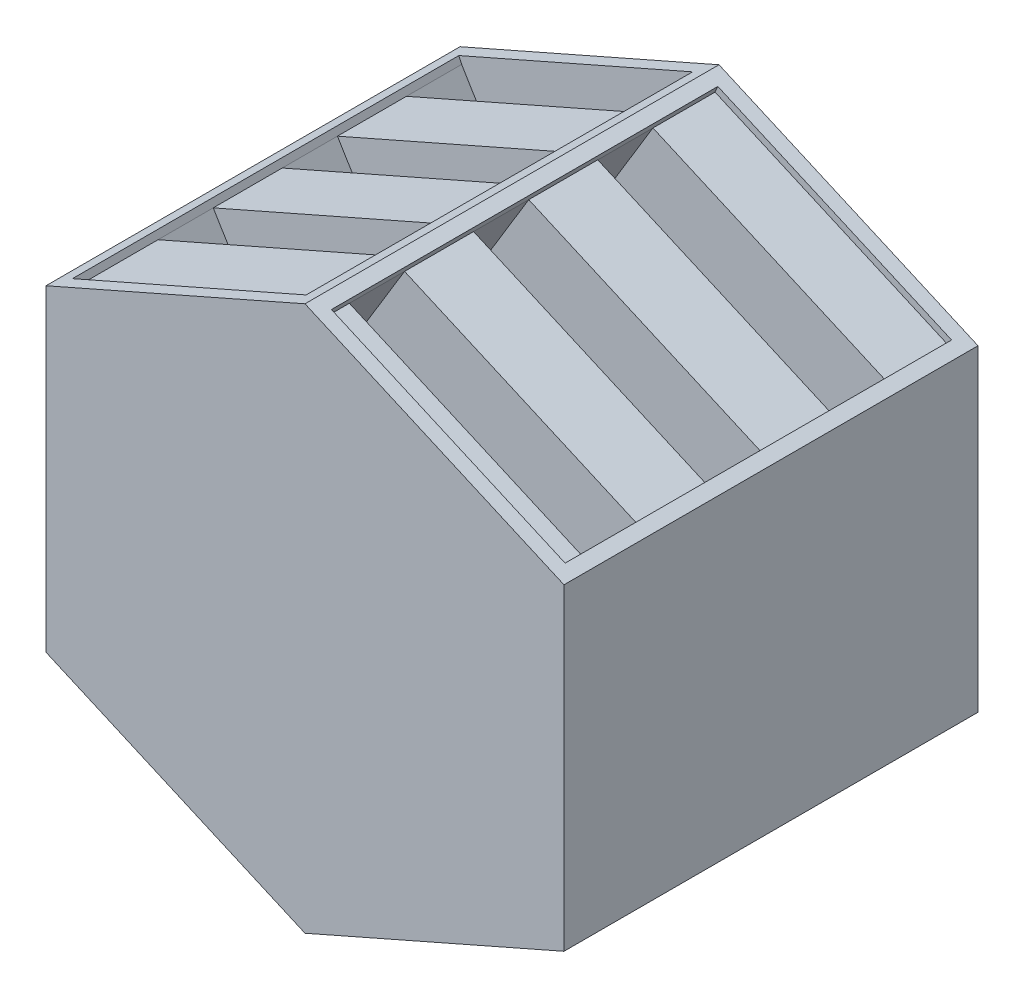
ISO-10303-21;
HEADER;
FILE_DESCRIPTION(('STEP AP214'),'2;1');
FILE_NAME('part.step','',(''),(''),'','','');
FILE_SCHEMA(('AUTOMOTIVE_DESIGN { 1 0 10303 214 1 1 1 1 }'));
ENDSEC;
DATA;
#1=APPLICATION_CONTEXT('core data for automotive mechanical design processes');
#2=APPLICATION_PROTOCOL_DEFINITION('international standard','automotive_design',2000,#1);
#3=PRODUCT_CONTEXT('',#1,'mechanical');
#4=PRODUCT('Part','Part','',(#3));
#5=PRODUCT_RELATED_PRODUCT_CATEGORY('part','',(#4));
#6=PRODUCT_DEFINITION_FORMATION('','',#4);
#7=PRODUCT_DEFINITION_CONTEXT('part definition',#1,'design');
#8=PRODUCT_DEFINITION('design','',#6,#7);
#9=PRODUCT_DEFINITION_SHAPE('','',#8);
#10=(LENGTH_UNIT() NAMED_UNIT(*) SI_UNIT(.MILLI.,.METRE.));
#11=(NAMED_UNIT(*) PLANE_ANGLE_UNIT() SI_UNIT($,.RADIAN.));
#12=(NAMED_UNIT(*) SI_UNIT($,.STERADIAN.) SOLID_ANGLE_UNIT());
#13=UNCERTAINTY_MEASURE_WITH_UNIT(LENGTH_MEASURE(1.E-05),#10,'distance_accuracy_value','');
#14=(GEOMETRIC_REPRESENTATION_CONTEXT(3) GLOBAL_UNCERTAINTY_ASSIGNED_CONTEXT((#13)) GLOBAL_UNIT_ASSIGNED_CONTEXT((#10,
#11,#12)) REPRESENTATION_CONTEXT('',''));
#15=CARTESIAN_POINT('',(0.,0.,0.));
#16=DIRECTION('',(0.,0.,1.));
#17=DIRECTION('',(1.,0.,0.));
#18=AXIS2_PLACEMENT_3D('',#15,#16,#17);
#19=CARTESIAN_POINT('',(7.14227281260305,39.9536376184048,-140.));
#20=DIRECTION('',(-0.402439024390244,-0.91544679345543,0.));
#21=DIRECTION('',(0.91544679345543,-0.402439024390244,0.));
#22=AXIS2_PLACEMENT_3D('',#19,#20,#21);
#23=PLANE('',#22);
#24=DIRECTION('',(-0.91544679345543,0.402439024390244,0.));
#25=VECTOR('',#24,1.);
#26=CARTESIAN_POINT('',(7.14227281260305,39.9536376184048,125.));
#27=LINE('',#26,#25);
#28=CARTESIAN_POINT('',(176.499929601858,-34.4975818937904,125.));
#29=VERTEX_POINT('',#28);
#30=CARTESIAN_POINT('',(7.14227281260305,39.9536376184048,125.));
#31=VERTEX_POINT('',#30);
#32=EDGE_CURVE('E47',#29,#31,#27,.T.);
#33=ORIENTED_EDGE('',*,*,#32,.T.);
#34=DIRECTION('',(0.,0.,1.));
#35=VECTOR('',#34,1.);
#36=CARTESIAN_POINT('',(7.14227281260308,39.9536376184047,140.));
#37=LINE('',#36,#35);
#38=CARTESIAN_POINT('',(7.14227281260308,39.9536376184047,140.));
#39=VERTEX_POINT('',#38);
#40=EDGE_CURVE('E339',#31,#39,#37,.T.);
#41=ORIENTED_EDGE('',*,*,#40,.T.);
#42=DIRECTION('',(0.91544679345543,-0.402439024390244,0.));
#43=VECTOR('',#42,1.);
#44=CARTESIAN_POINT('',(7.14227281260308,39.9536376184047,140.));
#45=LINE('',#44,#43);
#46=CARTESIAN_POINT('',(176.499929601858,-34.4975818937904,140.));
#47=VERTEX_POINT('',#46);
#48=EDGE_CURVE('E354',#39,#47,#45,.T.);
#49=ORIENTED_EDGE('',*,*,#48,.T.);
#50=DIRECTION('',(0.,0.,-1.));
#51=VECTOR('',#50,1.);
#52=CARTESIAN_POINT('',(176.499929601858,-34.4975818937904,140.));
#53=LINE('',#52,#51);
#54=EDGE_CURVE('E359',#47,#29,#53,.T.);
#55=ORIENTED_EDGE('',*,*,#54,.T.);
#56=EDGE_LOOP('',(#33,#41,#49,#55));
#57=FACE_BOUND('',#56,.T.);
#58=ADVANCED_FACE('F32',(#57),#23,.F.);
#59=CARTESIAN_POINT('',(-175.292612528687,-260.645554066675,-140.));
#60=DIRECTION('',(-0.402439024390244,-0.91544679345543,0.));
#61=DIRECTION('',(0.91544679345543,-0.402439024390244,0.));
#62=AXIS2_PLACEMENT_3D('',#59,#60,#61);
#63=PLANE('',#62);
#64=DIRECTION('',(0.,0.,-1.));
#65=VECTOR('',#64,1.);
#66=CARTESIAN_POINT('',(-175.292612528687,-260.645554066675,140.));
#67=LINE('',#66,#65);
#68=CARTESIAN_POINT('',(-175.292612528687,-260.645554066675,140.));
#69=VERTEX_POINT('',#68);
#70=CARTESIAN_POINT('',(-175.292612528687,-260.645554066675,125.));
#71=VERTEX_POINT('',#70);
#72=EDGE_CURVE('E677',#69,#71,#67,.T.);
#73=ORIENTED_EDGE('',*,*,#72,.T.);
#74=DIRECTION('',(0.91544679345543,-0.402439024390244,0.));
#75=VECTOR('',#74,1.);
#76=CARTESIAN_POINT('',(-175.292612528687,-260.645554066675,125.));
#77=LINE('',#76,#75);
#78=CARTESIAN_POINT('',(-5.93495573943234,-335.09677357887,125.));
#79=VERTEX_POINT('',#78);
#80=EDGE_CURVE('E755',#71,#79,#77,.T.);
#81=ORIENTED_EDGE('',*,*,#80,.T.);
#82=DIRECTION('',(0.,0.,1.));
#83=VECTOR('',#82,1.);
#84=CARTESIAN_POINT('',(-5.9349557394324,-335.09677357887,140.));
#85=LINE('',#84,#83);
#86=CARTESIAN_POINT('',(-5.9349557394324,-335.09677357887,140.));
#87=VERTEX_POINT('',#86);
#88=EDGE_CURVE('E684',#79,#87,#85,.T.);
#89=ORIENTED_EDGE('',*,*,#88,.T.);
#90=DIRECTION('',(-0.91544679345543,0.402439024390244,0.));
#91=VECTOR('',#90,1.);
#92=CARTESIAN_POINT('',(-175.292612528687,-260.645554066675,140.));
#93=LINE('',#92,#91);
#94=EDGE_CURVE('E688',#87,#69,#93,.T.);
#95=ORIENTED_EDGE('',*,*,#94,.T.);
#96=EDGE_LOOP('',(#73,#81,#89,#95));
#97=FACE_BOUND('',#96,.T.);
#98=ADVANCED_FACE('F454',(#97),#63,.T.);
#99=CARTESIAN_POINT('',(7.14227281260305,39.9536376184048,35.));
#100=VERTEX_POINT('',#99);
#101=CARTESIAN_POINT('',(7.14227281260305,39.9536376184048,85.));
#102=VERTEX_POINT('',#101);
#103=EDGE_CURVE('E337',#100,#102,#37,.T.);
#104=ORIENTED_EDGE('',*,*,#103,.T.);
#105=DIRECTION('',(-0.91544679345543,0.402439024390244,0.));
#106=VECTOR('',#105,1.);
#107=CARTESIAN_POINT('',(7.14227281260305,39.9536376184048,85.));
#108=LINE('',#107,#106);
#109=CARTESIAN_POINT('',(176.499929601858,-34.4975818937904,85.));
#110=VERTEX_POINT('',#109);
#111=EDGE_CURVE('E324',#110,#102,#108,.T.);
#112=ORIENTED_EDGE('',*,*,#111,.F.);
#113=CARTESIAN_POINT('',(176.499929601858,-34.4975818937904,35.));
#114=VERTEX_POINT('',#113);
#115=EDGE_CURVE('E363',#110,#114,#53,.T.);
#116=ORIENTED_EDGE('',*,*,#115,.T.);
#117=DIRECTION('',(-0.91544679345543,0.402439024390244,0.));
#118=VECTOR('',#117,1.);
#119=CARTESIAN_POINT('',(7.14227281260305,39.9536376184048,35.));
#120=LINE('',#119,#118);
#121=EDGE_CURVE('E345',#114,#100,#120,.T.);
#122=ORIENTED_EDGE('',*,*,#121,.T.);
#123=EDGE_LOOP('',(#104,#112,#116,#122));
#124=FACE_BOUND('',#123,.T.);
#125=ADVANCED_FACE('F343',(#124),#23,.F.);
#126=DIRECTION('',(0.91544679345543,-0.402439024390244,0.));
#127=VECTOR('',#126,1.);
#128=CARTESIAN_POINT('',(-175.292612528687,-260.645554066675,85.));
#129=LINE('',#128,#127);
#130=CARTESIAN_POINT('',(-175.292612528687,-260.645554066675,85.));
#131=VERTEX_POINT('',#130);
#132=CARTESIAN_POINT('',(-5.93495573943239,-335.09677357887,85.));
#133=VERTEX_POINT('',#132);
#134=EDGE_CURVE('E323',#131,#133,#129,.T.);
#135=ORIENTED_EDGE('',*,*,#134,.F.);
#136=CARTESIAN_POINT('',(-175.292612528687,-260.645554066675,35.));
#137=VERTEX_POINT('',#136);
#138=EDGE_CURVE('E681',#131,#137,#67,.T.);
#139=ORIENTED_EDGE('',*,*,#138,.T.);
#140=DIRECTION('',(0.91544679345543,-0.402439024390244,0.));
#141=VECTOR('',#140,1.);
#142=CARTESIAN_POINT('',(-175.292612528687,-260.645554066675,35.));
#143=LINE('',#142,#141);
#144=CARTESIAN_POINT('',(-5.93495573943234,-335.09677357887,35.));
#145=VERTEX_POINT('',#144);
#146=EDGE_CURVE('E781',#137,#145,#143,.T.);
#147=ORIENTED_EDGE('',*,*,#146,.T.);
#148=EDGE_CURVE('E796',#145,#133,#85,.T.);
#149=ORIENTED_EDGE('',*,*,#148,.T.);
#150=EDGE_LOOP('',(#135,#139,#147,#149));
#151=FACE_BOUND('',#150,.T.);
#152=ADVANCED_FACE('F463',(#151),#63,.T.);
#153=CARTESIAN_POINT('',(-176.499929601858,-34.4975818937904,140.));
#154=DIRECTION('',(-0.402439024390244,0.91544679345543,0.));
#155=DIRECTION('',(-0.91544679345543,-0.402439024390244,0.));
#156=AXIS2_PLACEMENT_3D('',#153,#154,#155);
#157=PLANE('',#156);
#158=DIRECTION('',(0.,0.,1.));
#159=VECTOR('',#158,1.);
#160=CARTESIAN_POINT('',(-176.499929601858,-34.4975818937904,-140.));
#161=LINE('',#160,#159);
#162=CARTESIAN_POINT('',(-176.499929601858,-34.4975818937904,-9.99999999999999));
#163=VERTEX_POINT('',#162);
#164=CARTESIAN_POINT('',(-176.499929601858,-34.4975818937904,40.));
#165=VERTEX_POINT('',#164);
#166=EDGE_CURVE('E897',#163,#165,#161,.T.);
#167=ORIENTED_EDGE('',*,*,#166,.T.);
#168=DIRECTION('',(-0.91544679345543,-0.402439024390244,0.));
#169=VECTOR('',#168,1.);
#170=CARTESIAN_POINT('',(-176.499929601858,-34.4975818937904,40.));
#171=LINE('',#170,#169);
#172=CARTESIAN_POINT('',(-7.14227281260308,39.9536376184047,40.));
#173=VERTEX_POINT('',#172);
#174=EDGE_CURVE('E511',#173,#165,#171,.T.);
#175=ORIENTED_EDGE('',*,*,#174,.F.);
#176=DIRECTION('',(0.,0.,-1.));
#177=VECTOR('',#176,1.);
#178=CARTESIAN_POINT('',(-7.14227281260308,39.9536376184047,-140.));
#179=LINE('',#178,#177);
#180=CARTESIAN_POINT('',(-7.14227281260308,39.9536376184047,-9.99999999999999));
#181=VERTEX_POINT('',#180);
#182=EDGE_CURVE('E725',#173,#181,#179,.T.);
#183=ORIENTED_EDGE('',*,*,#182,.T.);
#184=DIRECTION('',(-0.91544679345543,-0.402439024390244,0.));
#185=VECTOR('',#184,1.);
#186=CARTESIAN_POINT('',(-176.499929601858,-34.4975818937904,-9.99999999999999));
#187=LINE('',#186,#185);
#188=EDGE_CURVE('E560',#181,#163,#187,.T.);
#189=ORIENTED_EDGE('',*,*,#188,.T.);
#190=EDGE_LOOP('',(#167,#175,#183,#189));
#191=FACE_BOUND('',#190,.T.);
#192=ADVANCED_FACE('F850',(#191),#157,.T.);
#193=CARTESIAN_POINT('',(5.93495573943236,-335.09677357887,-140.));
#194=DIRECTION('',(0.402439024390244,-0.91544679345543,0.));
#195=DIRECTION('',(0.91544679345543,0.402439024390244,0.));
#196=AXIS2_PLACEMENT_3D('',#193,#194,#195);
#197=PLANE('',#196);
#198=DIRECTION('',(0.,0.,1.));
#199=VECTOR('',#198,1.);
#200=CARTESIAN_POINT('',(175.292612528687,-260.645554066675,140.));
#201=LINE('',#200,#199);
#202=CARTESIAN_POINT('',(175.292612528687,-260.645554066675,-9.99999999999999));
#203=VERTEX_POINT('',#202);
#204=CARTESIAN_POINT('',(175.292612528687,-260.645554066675,40.));
#205=VERTEX_POINT('',#204);
#206=EDGE_CURVE('E951',#203,#205,#201,.T.);
#207=ORIENTED_EDGE('',*,*,#206,.T.);
#208=DIRECTION('',(0.91544679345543,0.402439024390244,0.));
#209=VECTOR('',#208,1.);
#210=CARTESIAN_POINT('',(175.292612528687,-260.645554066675,40.));
#211=LINE('',#210,#209);
#212=CARTESIAN_POINT('',(5.93495573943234,-335.09677357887,40.));
#213=VERTEX_POINT('',#212);
#214=EDGE_CURVE('E524',#213,#205,#211,.T.);
#215=ORIENTED_EDGE('',*,*,#214,.F.);
#216=DIRECTION('',(0.,0.,-1.));
#217=VECTOR('',#216,1.);
#218=CARTESIAN_POINT('',(5.93495573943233,-335.09677357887,140.));
#219=LINE('',#218,#217);
#220=CARTESIAN_POINT('',(5.93495573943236,-335.09677357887,-9.99999999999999));
#221=VERTEX_POINT('',#220);
#222=EDGE_CURVE('E649',#213,#221,#219,.T.);
#223=ORIENTED_EDGE('',*,*,#222,.T.);
#224=DIRECTION('',(0.91544679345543,0.402439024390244,0.));
#225=VECTOR('',#224,1.);
#226=CARTESIAN_POINT('',(175.292612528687,-260.645554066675,-9.99999999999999));
#227=LINE('',#226,#225);
#228=EDGE_CURVE('E566',#221,#203,#227,.T.);
#229=ORIENTED_EDGE('',*,*,#228,.T.);
#230=EDGE_LOOP('',(#207,#215,#223,#229));
#231=FACE_BOUND('',#230,.T.);
#232=ADVANCED_FACE('F495',(#231),#197,.T.);
#233=CARTESIAN_POINT('',(-176.499929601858,-34.4975818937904,-100.));
#234=VERTEX_POINT('',#233);
#235=CARTESIAN_POINT('',(-176.499929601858,-34.4975818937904,-50.));
#236=VERTEX_POINT('',#235);
#237=EDGE_CURVE('E717',#234,#236,#161,.T.);
#238=ORIENTED_EDGE('',*,*,#237,.T.);
#239=DIRECTION('',(-0.91544679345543,-0.402439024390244,0.));
#240=VECTOR('',#239,1.);
#241=CARTESIAN_POINT('',(-176.499929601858,-34.4975818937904,-50.));
#242=LINE('',#241,#240);
#243=CARTESIAN_POINT('',(-7.14227281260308,39.9536376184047,-50.));
#244=VERTEX_POINT('',#243);
#245=EDGE_CURVE('E549',#244,#236,#242,.T.);
#246=ORIENTED_EDGE('',*,*,#245,.F.);
#247=CARTESIAN_POINT('',(-7.14227281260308,39.9536376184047,-100.));
#248=VERTEX_POINT('',#247);
#249=EDGE_CURVE('E720',#244,#248,#179,.T.);
#250=ORIENTED_EDGE('',*,*,#249,.T.);
#251=DIRECTION('',(-0.91544679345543,-0.402439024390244,0.));
#252=VECTOR('',#251,1.);
#253=CARTESIAN_POINT('',(-176.499929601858,-34.4975818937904,-100.));
#254=LINE('',#253,#252);
#255=EDGE_CURVE('E617',#248,#234,#254,.T.);
#256=ORIENTED_EDGE('',*,*,#255,.T.);
#257=EDGE_LOOP('',(#238,#246,#250,#256));
#258=FACE_BOUND('',#257,.T.);
#259=ADVANCED_FACE('F491',(#258),#157,.T.);
#260=CARTESIAN_POINT('',(175.292612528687,-260.645554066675,-100.));
#261=VERTEX_POINT('',#260);
#262=CARTESIAN_POINT('',(175.292612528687,-260.645554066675,-50.));
#263=VERTEX_POINT('',#262);
#264=EDGE_CURVE('E653',#261,#263,#201,.T.);
#265=ORIENTED_EDGE('',*,*,#264,.T.);
#266=DIRECTION('',(0.91544679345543,0.402439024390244,0.));
#267=VECTOR('',#266,1.);
#268=CARTESIAN_POINT('',(175.292612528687,-260.645554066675,-50.));
#269=LINE('',#268,#267);
#270=CARTESIAN_POINT('',(5.93495573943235,-335.09677357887,-50.));
#271=VERTEX_POINT('',#270);
#272=EDGE_CURVE('E555',#271,#263,#269,.T.);
#273=ORIENTED_EDGE('',*,*,#272,.F.);
#274=CARTESIAN_POINT('',(5.93495573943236,-335.09677357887,-100.));
#275=VERTEX_POINT('',#274);
#276=EDGE_CURVE('E644',#271,#275,#219,.T.);
#277=ORIENTED_EDGE('',*,*,#276,.T.);
#278=DIRECTION('',(0.91544679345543,0.402439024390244,0.));
#279=VECTOR('',#278,1.);
#280=CARTESIAN_POINT('',(175.292612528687,-260.645554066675,-100.));
#281=LINE('',#280,#279);
#282=EDGE_CURVE('E623',#275,#261,#281,.T.);
#283=ORIENTED_EDGE('',*,*,#282,.T.);
#284=EDGE_LOOP('',(#265,#273,#277,#283));
#285=FACE_BOUND('',#284,.T.);
#286=ADVANCED_FACE('F484',(#285),#197,.T.);
#287=CARTESIAN_POINT('',(7.14227281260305,39.9536376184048,-55.));
#288=VERTEX_POINT('',#287);
#289=CARTESIAN_POINT('',(7.14227281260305,39.9536376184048,-5.00000000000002));
#290=VERTEX_POINT('',#289);
#291=EDGE_CURVE('E346',#288,#290,#37,.T.);
#292=ORIENTED_EDGE('',*,*,#291,.T.);
#293=DIRECTION('',(-0.91544679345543,0.402439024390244,0.));
#294=VECTOR('',#293,1.);
#295=CARTESIAN_POINT('',(7.14227281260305,39.9536376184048,-5.00000000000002));
#296=LINE('',#295,#294);
#297=CARTESIAN_POINT('',(176.499929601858,-34.4975818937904,-5.00000000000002));
#298=VERTEX_POINT('',#297);
#299=EDGE_CURVE('E340',#298,#290,#296,.T.);
#300=ORIENTED_EDGE('',*,*,#299,.F.);
#301=CARTESIAN_POINT('',(176.499929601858,-34.4975818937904,-55.));
#302=VERTEX_POINT('',#301);
#303=EDGE_CURVE('E837',#298,#302,#53,.T.);
#304=ORIENTED_EDGE('',*,*,#303,.T.);
#305=DIRECTION('',(-0.91544679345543,0.402439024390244,0.));
#306=VECTOR('',#305,1.);
#307=CARTESIAN_POINT('',(7.14227281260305,39.9536376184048,-55.));
#308=LINE('',#307,#306);
#309=EDGE_CURVE('E502',#302,#288,#308,.T.);
#310=ORIENTED_EDGE('',*,*,#309,.T.);
#311=EDGE_LOOP('',(#292,#300,#304,#310));
#312=FACE_BOUND('',#311,.T.);
#313=ADVANCED_FACE('F468',(#312),#23,.F.);
#314=DIRECTION('',(0.91544679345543,-0.402439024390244,0.));
#315=VECTOR('',#314,1.);
#316=CARTESIAN_POINT('',(-175.292612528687,-260.645554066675,-5.00000000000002));
#317=LINE('',#316,#315);
#318=CARTESIAN_POINT('',(-175.292612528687,-260.645554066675,-5.00000000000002));
#319=VERTEX_POINT('',#318);
#320=CARTESIAN_POINT('',(-5.93495573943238,-335.09677357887,-5.));
#321=VERTEX_POINT('',#320);
#322=EDGE_CURVE('E773',#319,#321,#317,.T.);
#323=ORIENTED_EDGE('',*,*,#322,.F.);
#324=CARTESIAN_POINT('',(-175.292612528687,-260.645554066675,-55.));
#325=VERTEX_POINT('',#324);
#326=EDGE_CURVE('E817',#319,#325,#67,.T.);
#327=ORIENTED_EDGE('',*,*,#326,.T.);
#328=DIRECTION('',(0.91544679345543,-0.402439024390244,0.));
#329=VECTOR('',#328,1.);
#330=CARTESIAN_POINT('',(-175.292612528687,-260.645554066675,-55.));
#331=LINE('',#330,#329);
#332=CARTESIAN_POINT('',(-5.93495573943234,-335.09677357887,-55.));
#333=VERTEX_POINT('',#332);
#334=EDGE_CURVE('E597',#325,#333,#331,.T.);
#335=ORIENTED_EDGE('',*,*,#334,.T.);
#336=EDGE_CURVE('E689',#333,#321,#85,.T.);
#337=ORIENTED_EDGE('',*,*,#336,.T.);
#338=EDGE_LOOP('',(#323,#327,#335,#337));
#339=FACE_BOUND('',#338,.T.);
#340=ADVANCED_FACE('F483',(#339),#63,.T.);
#341=CARTESIAN_POINT('',(0.,-346.444738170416,150.));
#342=DIRECTION('',(0.402439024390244,0.91544679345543,0.));
#343=DIRECTION('',(-0.91544679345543,0.402439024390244,0.));
#344=AXIS2_PLACEMENT_3D('',#341,#342,#343);
#345=PLANE('',#344);
#346=DIRECTION('',(0.91544679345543,-0.402439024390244,0.));
#347=VECTOR('',#346,1.);
#348=CARTESIAN_POINT('',(-178.512124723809,-267.969128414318,-140.));
#349=LINE('',#348,#347);
#350=CARTESIAN_POINT('',(-178.512124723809,-267.969128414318,-140.));
#351=VERTEX_POINT('',#350);
#352=CARTESIAN_POINT('',(-9.15446793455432,-342.420347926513,-140.));
#353=VERTEX_POINT('',#352);
#354=EDGE_CURVE('E667',#351,#353,#349,.T.);
#355=ORIENTED_EDGE('',*,*,#354,.F.);
#356=DIRECTION('',(0.,0.,-1.));
#357=VECTOR('',#356,1.);
#358=CARTESIAN_POINT('',(-178.512124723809,-267.969128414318,140.));
#359=LINE('',#358,#357);
#360=CARTESIAN_POINT('',(-178.512124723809,-267.969128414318,140.));
#361=VERTEX_POINT('',#360);
#362=EDGE_CURVE('E659',#361,#351,#359,.T.);
#363=ORIENTED_EDGE('',*,*,#362,.F.);
#364=DIRECTION('',(-0.91544679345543,0.402439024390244,0.));
#365=VECTOR('',#364,1.);
#366=CARTESIAN_POINT('',(-178.512124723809,-267.969128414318,140.));
#367=LINE('',#366,#365);
#368=CARTESIAN_POINT('',(-9.15446793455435,-342.420347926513,140.));
#369=VERTEX_POINT('',#368);
#370=EDGE_CURVE('E673',#369,#361,#367,.T.);
#371=ORIENTED_EDGE('',*,*,#370,.F.);
#372=DIRECTION('',(0.,0.,1.));
#373=VECTOR('',#372,1.);
#374=CARTESIAN_POINT('',(-9.15446793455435,-342.420347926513,140.));
#375=LINE('',#374,#373);
#376=EDGE_CURVE('E670',#353,#369,#375,.T.);
#377=ORIENTED_EDGE('',*,*,#376,.F.);
#378=EDGE_LOOP('',(#355,#363,#371,#377));
#379=FACE_BOUND('',#378,.T.);
#380=DIRECTION('',(0.91544679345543,-0.402439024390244,0.));
#381=VECTOR('',#380,1.);
#382=CARTESIAN_POINT('',(0.,-346.444738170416,-150.));
#383=LINE('',#382,#381);
#384=CARTESIAN_POINT('',(-187.666592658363,-263.944738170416,-150.));
#385=VERTEX_POINT('',#384);
#386=CARTESIAN_POINT('',(0.,-346.444738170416,-150.));
#387=VERTEX_POINT('',#386);
#388=EDGE_CURVE('E369',#385,#387,#383,.T.);
#389=ORIENTED_EDGE('',*,*,#388,.T.);
#390=DIRECTION('',(0.,0.,-1.));
#391=VECTOR('',#390,1.);
#392=CARTESIAN_POINT('',(0.,-346.444738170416,150.));
#393=LINE('',#392,#391);
#394=CARTESIAN_POINT('',(0.,-346.444738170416,150.));
#395=VERTEX_POINT('',#394);
#396=EDGE_CURVE('E11',#395,#387,#393,.T.);
#397=ORIENTED_EDGE('',*,*,#396,.F.);
#398=DIRECTION('',(0.91544679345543,-0.402439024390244,0.));
#399=VECTOR('',#398,1.);
#400=CARTESIAN_POINT('',(0.,-346.444738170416,150.));
#401=LINE('',#400,#399);
#402=CARTESIAN_POINT('',(-187.666592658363,-263.944738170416,150.));
#403=VERTEX_POINT('',#402);
#404=EDGE_CURVE('E388',#403,#395,#401,.T.);
#405=ORIENTED_EDGE('',*,*,#404,.F.);
#406=DIRECTION('',(0.,0.,-1.));
#407=VECTOR('',#406,1.);
#408=CARTESIAN_POINT('',(-187.666592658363,-263.944738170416,150.));
#409=LINE('',#408,#407);
#410=EDGE_CURVE('E401',#403,#385,#409,.T.);
#411=ORIENTED_EDGE('',*,*,#410,.T.);
#412=EDGE_LOOP('',(#389,#397,#405,#411));
#413=FACE_BOUND('',#412,.T.);
#414=ADVANCED_FACE('F34',(#379,#413),#345,.F.);
#415=CARTESIAN_POINT('',(187.666592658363,-263.944738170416,150.));
#416=DIRECTION('',(-0.402439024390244,0.91544679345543,0.));
#417=DIRECTION('',(-0.91544679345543,-0.402439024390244,0.));
#418=AXIS2_PLACEMENT_3D('',#415,#416,#417);
#419=PLANE('',#418);
#420=DIRECTION('',(0.91544679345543,0.402439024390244,0.));
#421=VECTOR('',#420,1.);
#422=CARTESIAN_POINT('',(9.15446793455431,-342.420347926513,-140.));
#423=LINE('',#422,#421);
#424=CARTESIAN_POINT('',(9.15446793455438,-342.420347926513,-140.));
#425=VERTEX_POINT('',#424);
#426=CARTESIAN_POINT('',(178.512124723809,-267.969128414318,-140.));
#427=VERTEX_POINT('',#426);
#428=EDGE_CURVE('E635',#425,#427,#423,.T.);
#429=ORIENTED_EDGE('',*,*,#428,.F.);
#430=DIRECTION('',(0.,0.,-1.));
#431=VECTOR('',#430,1.);
#432=CARTESIAN_POINT('',(9.15446793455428,-342.420347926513,140.));
#433=LINE('',#432,#431);
#434=CARTESIAN_POINT('',(9.15446793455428,-342.420347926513,140.));
#435=VERTEX_POINT('',#434);
#436=EDGE_CURVE('E633',#435,#425,#433,.T.);
#437=ORIENTED_EDGE('',*,*,#436,.F.);
#438=DIRECTION('',(-0.91544679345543,-0.402439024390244,0.));
#439=VECTOR('',#438,1.);
#440=CARTESIAN_POINT('',(9.15446793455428,-342.420347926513,140.));
#441=LINE('',#440,#439);
#442=CARTESIAN_POINT('',(178.512124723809,-267.969128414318,140.));
#443=VERTEX_POINT('',#442);
#444=EDGE_CURVE('E641',#443,#435,#441,.T.);
#445=ORIENTED_EDGE('',*,*,#444,.F.);
#446=DIRECTION('',(0.,0.,1.));
#447=VECTOR('',#446,1.);
#448=CARTESIAN_POINT('',(178.512124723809,-267.969128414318,140.));
#449=LINE('',#448,#447);
#450=EDGE_CURVE('E638',#427,#443,#449,.T.);
#451=ORIENTED_EDGE('',*,*,#450,.F.);
#452=EDGE_LOOP('',(#429,#437,#445,#451));
#453=FACE_BOUND('',#452,.T.);
#454=DIRECTION('',(0.91544679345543,0.402439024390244,0.));
#455=VECTOR('',#454,1.);
#456=CARTESIAN_POINT('',(187.666592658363,-263.944738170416,-150.));
#457=LINE('',#456,#455);
#458=CARTESIAN_POINT('',(187.666592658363,-263.944738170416,-150.));
#459=VERTEX_POINT('',#458);
#460=EDGE_CURVE('E378',#387,#459,#457,.T.);
#461=ORIENTED_EDGE('',*,*,#460,.T.);
#462=DIRECTION('',(0.,0.,-1.));
#463=VECTOR('',#462,1.);
#464=CARTESIAN_POINT('',(187.666592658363,-263.944738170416,150.));
#465=LINE('',#464,#463);
#466=CARTESIAN_POINT('',(187.666592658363,-263.944738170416,150.));
#467=VERTEX_POINT('',#466);
#468=EDGE_CURVE('E40',#467,#459,#465,.T.);
#469=ORIENTED_EDGE('',*,*,#468,.F.);
#470=DIRECTION('',(0.91544679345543,0.402439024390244,0.));
#471=VECTOR('',#470,1.);
#472=CARTESIAN_POINT('',(187.666592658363,-263.944738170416,150.));
#473=LINE('',#472,#471);
#474=EDGE_CURVE('E391',#395,#467,#473,.T.);
#475=ORIENTED_EDGE('',*,*,#474,.F.);
#476=ORIENTED_EDGE('',*,*,#396,.T.);
#477=EDGE_LOOP('',(#461,#469,#475,#476));
#478=FACE_BOUND('',#477,.T.);
#479=ADVANCED_FACE('F440',(#453,#478),#419,.F.);
#480=CARTESIAN_POINT('',(187.666592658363,-33.9447381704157,150.));
#481=DIRECTION('',(-1.,0.,0.));
#482=DIRECTION('',(0.,0.,1.));
#483=AXIS2_PLACEMENT_3D('',#480,#481,#482);
#484=PLANE('',#483);
#485=DIRECTION('',(0.,1.,0.));
#486=VECTOR('',#485,1.);
#487=CARTESIAN_POINT('',(187.666592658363,-33.9447381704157,-150.));
#488=LINE('',#487,#486);
#489=CARTESIAN_POINT('',(187.666592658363,-33.9447381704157,-150.));
#490=VERTEX_POINT('',#489);
#491=EDGE_CURVE('E380',#459,#490,#488,.T.);
#492=ORIENTED_EDGE('',*,*,#491,.T.);
#493=DIRECTION('',(0.,0.,-1.));
#494=VECTOR('',#493,1.);
#495=CARTESIAN_POINT('',(187.666592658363,-33.9447381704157,150.));
#496=LINE('',#495,#494);
#497=CARTESIAN_POINT('',(187.666592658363,-33.9447381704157,150.));
#498=VERTEX_POINT('',#497);
#499=EDGE_CURVE('E410',#498,#490,#496,.T.);
#500=ORIENTED_EDGE('',*,*,#499,.F.);
#501=DIRECTION('',(0.,1.,0.));
#502=VECTOR('',#501,1.);
#503=CARTESIAN_POINT('',(187.666592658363,-33.9447381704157,150.));
#504=LINE('',#503,#502);
#505=EDGE_CURVE('E393',#467,#498,#504,.T.);
#506=ORIENTED_EDGE('',*,*,#505,.F.);
#507=ORIENTED_EDGE('',*,*,#468,.T.);
#508=EDGE_LOOP('',(#492,#500,#506,#507));
#509=FACE_BOUND('',#508,.T.);
#510=ADVANCED_FACE('F417',(#509),#484,.F.);
#511=CARTESIAN_POINT('',(0.,48.5552618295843,150.));
#512=DIRECTION('',(-0.402439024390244,-0.91544679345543,0.));
#513=DIRECTION('',(0.91544679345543,-0.402439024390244,0.));
#514=AXIS2_PLACEMENT_3D('',#511,#512,#513);
#515=PLANE('',#514);
#516=DIRECTION('',(0.91544679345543,-0.402439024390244,0.));
#517=VECTOR('',#516,1.);
#518=CARTESIAN_POINT('',(9.1544679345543,44.5308715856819,140.));
#519=LINE('',#518,#517);
#520=CARTESIAN_POINT('',(9.15446793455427,44.5308715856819,140.));
#521=VERTEX_POINT('',#520);
#522=CARTESIAN_POINT('',(178.512124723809,-29.9203479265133,140.));
#523=VERTEX_POINT('',#522);
#524=EDGE_CURVE('E736',#521,#523,#519,.T.);
#525=ORIENTED_EDGE('',*,*,#524,.F.);
#526=DIRECTION('',(0.,0.,1.));
#527=VECTOR('',#526,1.);
#528=CARTESIAN_POINT('',(9.1544679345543,44.5308715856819,140.));
#529=LINE('',#528,#527);
#530=CARTESIAN_POINT('',(9.15446793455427,44.5308715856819,-140.));
#531=VERTEX_POINT('',#530);
#532=EDGE_CURVE('E728',#531,#521,#529,.T.);
#533=ORIENTED_EDGE('',*,*,#532,.F.);
#534=DIRECTION('',(-0.91544679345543,0.402439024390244,0.));
#535=VECTOR('',#534,1.);
#536=CARTESIAN_POINT('',(9.15446793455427,44.5308715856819,-140.));
#537=LINE('',#536,#535);
#538=CARTESIAN_POINT('',(178.512124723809,-29.9203479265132,-140.));
#539=VERTEX_POINT('',#538);
#540=EDGE_CURVE('E350',#539,#531,#537,.T.);
#541=ORIENTED_EDGE('',*,*,#540,.F.);
#542=DIRECTION('',(0.,0.,-1.));
#543=VECTOR('',#542,1.);
#544=CARTESIAN_POINT('',(178.512124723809,-29.9203479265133,140.));
#545=LINE('',#544,#543);
#546=EDGE_CURVE('E738',#523,#539,#545,.T.);
#547=ORIENTED_EDGE('',*,*,#546,.F.);
#548=EDGE_LOOP('',(#525,#533,#541,#547));
#549=FACE_BOUND('',#548,.T.);
#550=DIRECTION('',(-0.91544679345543,0.402439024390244,0.));
#551=VECTOR('',#550,1.);
#552=CARTESIAN_POINT('',(0.,48.5552618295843,-150.));
#553=LINE('',#552,#551);
#554=CARTESIAN_POINT('',(0.,48.5552618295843,-150.));
#555=VERTEX_POINT('',#554);
#556=EDGE_CURVE('E382',#490,#555,#553,.T.);
#557=ORIENTED_EDGE('',*,*,#556,.T.);
#558=DIRECTION('',(0.,0.,-1.));
#559=VECTOR('',#558,1.);
#560=CARTESIAN_POINT('',(0.,48.5552618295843,150.));
#561=LINE('',#560,#559);
#562=CARTESIAN_POINT('',(0.,48.5552618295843,150.));
#563=VERTEX_POINT('',#562);
#564=EDGE_CURVE('E407',#563,#555,#561,.T.);
#565=ORIENTED_EDGE('',*,*,#564,.F.);
#566=DIRECTION('',(-0.91544679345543,0.402439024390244,0.));
#567=VECTOR('',#566,1.);
#568=CARTESIAN_POINT('',(0.,48.5552618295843,150.));
#569=LINE('',#568,#567);
#570=EDGE_CURVE('E395',#498,#563,#569,.T.);
#571=ORIENTED_EDGE('',*,*,#570,.F.);
#572=ORIENTED_EDGE('',*,*,#499,.T.);
#573=EDGE_LOOP('',(#557,#565,#571,#572));
#574=FACE_BOUND('',#573,.T.);
#575=ADVANCED_FACE('F428',(#549,#574),#515,.F.);
#576=CARTESIAN_POINT('',(-187.666592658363,-33.9447381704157,150.));
#577=DIRECTION('',(0.402439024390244,-0.91544679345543,0.));
#578=DIRECTION('',(0.91544679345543,0.402439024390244,0.));
#579=AXIS2_PLACEMENT_3D('',#576,#577,#578);
#580=PLANE('',#579);
#581=DIRECTION('',(0.91544679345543,0.402439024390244,0.));
#582=VECTOR('',#581,1.);
#583=CARTESIAN_POINT('',(-178.512124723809,-29.9203479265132,140.));
#584=LINE('',#583,#582);
#585=CARTESIAN_POINT('',(-178.512124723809,-29.9203479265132,140.));
#586=VERTEX_POINT('',#585);
#587=CARTESIAN_POINT('',(-9.1544679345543,44.5308715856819,140.));
#588=VERTEX_POINT('',#587);
#589=EDGE_CURVE('E703',#586,#588,#584,.T.);
#590=ORIENTED_EDGE('',*,*,#589,.F.);
#591=DIRECTION('',(0.,0.,1.));
#592=VECTOR('',#591,1.);
#593=CARTESIAN_POINT('',(-178.512124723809,-29.9203479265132,-140.));
#594=LINE('',#593,#592);
#595=CARTESIAN_POINT('',(-178.512124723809,-29.9203479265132,-140.));
#596=VERTEX_POINT('',#595);
#597=EDGE_CURVE('E695',#596,#586,#594,.T.);
#598=ORIENTED_EDGE('',*,*,#597,.F.);
#599=DIRECTION('',(-0.91544679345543,-0.402439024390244,0.));
#600=VECTOR('',#599,1.);
#601=CARTESIAN_POINT('',(-178.512124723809,-29.9203479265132,-140.));
#602=LINE('',#601,#600);
#603=CARTESIAN_POINT('',(-9.1544679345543,44.5308715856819,-140.));
#604=VERTEX_POINT('',#603);
#605=EDGE_CURVE('E709',#604,#596,#602,.T.);
#606=ORIENTED_EDGE('',*,*,#605,.F.);
#607=DIRECTION('',(0.,0.,-1.));
#608=VECTOR('',#607,1.);
#609=CARTESIAN_POINT('',(-9.1544679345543,44.5308715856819,-140.));
#610=LINE('',#609,#608);
#611=EDGE_CURVE('E706',#588,#604,#610,.T.);
#612=ORIENTED_EDGE('',*,*,#611,.F.);
#613=EDGE_LOOP('',(#590,#598,#606,#612));
#614=FACE_BOUND('',#613,.T.);
#615=DIRECTION('',(-0.91544679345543,-0.402439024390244,0.));
#616=VECTOR('',#615,1.);
#617=CARTESIAN_POINT('',(-187.666592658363,-33.9447381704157,-150.));
#618=LINE('',#617,#616);
#619=CARTESIAN_POINT('',(-187.666592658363,-33.9447381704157,-150.));
#620=VERTEX_POINT('',#619);
#621=EDGE_CURVE('E384',#555,#620,#618,.T.);
#622=ORIENTED_EDGE('',*,*,#621,.T.);
#623=DIRECTION('',(0.,0.,-1.));
#624=VECTOR('',#623,1.);
#625=CARTESIAN_POINT('',(-187.666592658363,-33.9447381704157,150.));
#626=LINE('',#625,#624);
#627=CARTESIAN_POINT('',(-187.666592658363,-33.9447381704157,150.));
#628=VERTEX_POINT('',#627);
#629=EDGE_CURVE('E404',#628,#620,#626,.T.);
#630=ORIENTED_EDGE('',*,*,#629,.F.);
#631=DIRECTION('',(-0.91544679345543,-0.402439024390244,0.));
#632=VECTOR('',#631,1.);
#633=CARTESIAN_POINT('',(-187.666592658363,-33.9447381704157,150.));
#634=LINE('',#633,#632);
#635=EDGE_CURVE('E397',#563,#628,#634,.T.);
#636=ORIENTED_EDGE('',*,*,#635,.F.);
#637=ORIENTED_EDGE('',*,*,#564,.T.);
#638=EDGE_LOOP('',(#622,#630,#636,#637));
#639=FACE_BOUND('',#638,.T.);
#640=ADVANCED_FACE('F432',(#614,#639),#580,.F.);
#641=CARTESIAN_POINT('',(-187.666592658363,-263.944738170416,150.));
#642=DIRECTION('',(1.,0.,0.));
#643=DIRECTION('',(0.,0.,-1.));
#644=AXIS2_PLACEMENT_3D('',#641,#642,#643);
#645=PLANE('',#644);
#646=DIRECTION('',(0.,-1.,0.));
#647=VECTOR('',#646,1.);
#648=CARTESIAN_POINT('',(-187.666592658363,-263.944738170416,-150.));
#649=LINE('',#648,#647);
#650=EDGE_CURVE('E386',#620,#385,#649,.T.);
#651=ORIENTED_EDGE('',*,*,#650,.T.);
#652=ORIENTED_EDGE('',*,*,#410,.F.);
#653=DIRECTION('',(0.,-1.,0.));
#654=VECTOR('',#653,1.);
#655=CARTESIAN_POINT('',(-187.666592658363,-263.944738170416,150.));
#656=LINE('',#655,#654);
#657=EDGE_CURVE('E399',#628,#403,#656,.T.);
#658=ORIENTED_EDGE('',*,*,#657,.F.);
#659=ORIENTED_EDGE('',*,*,#629,.T.);
#660=EDGE_LOOP('',(#651,#652,#658,#659));
#661=FACE_BOUND('',#660,.T.);
#662=ADVANCED_FACE('F443',(#661),#645,.F.);
#663=CARTESIAN_POINT('',(-187.666592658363,-263.944738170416,150.));
#664=DIRECTION('',(0.,0.,-1.));
#665=DIRECTION('',(-1.,0.,0.));
#666=AXIS2_PLACEMENT_3D('',#663,#664,#665);
#667=PLANE('',#666);
#668=ORIENTED_EDGE('',*,*,#404,.T.);
#669=ORIENTED_EDGE('',*,*,#474,.T.);
#670=ORIENTED_EDGE('',*,*,#505,.T.);
#671=ORIENTED_EDGE('',*,*,#570,.T.);
#672=ORIENTED_EDGE('',*,*,#635,.T.);
#673=ORIENTED_EDGE('',*,*,#657,.T.);
#674=EDGE_LOOP('',(#668,#669,#670,#671,#672,#673));
#675=FACE_BOUND('',#674,.T.);
#676=ADVANCED_FACE('F436',(#675),#667,.F.);
#677=CARTESIAN_POINT('',(-187.666592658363,-263.944738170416,-150.));
#678=DIRECTION('',(0.,0.,-1.));
#679=DIRECTION('',(-1.,0.,0.));
#680=AXIS2_PLACEMENT_3D('',#677,#678,#679);
#681=PLANE('',#680);
#682=ORIENTED_EDGE('',*,*,#388,.F.);
#683=ORIENTED_EDGE('',*,*,#650,.F.);
#684=ORIENTED_EDGE('',*,*,#621,.F.);
#685=ORIENTED_EDGE('',*,*,#556,.F.);
#686=ORIENTED_EDGE('',*,*,#491,.F.);
#687=ORIENTED_EDGE('',*,*,#460,.F.);
#688=EDGE_LOOP('',(#682,#683,#684,#685,#686,#687));
#689=FACE_BOUND('',#688,.T.);
#690=ADVANCED_FACE('F423',(#689),#681,.T.);
#691=CARTESIAN_POINT('',(7.14227281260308,39.9536376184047,140.));
#692=DIRECTION('',(-0.91544679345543,0.402439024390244,0.));
#693=DIRECTION('',(-0.402439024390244,-0.91544679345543,0.));
#694=AXIS2_PLACEMENT_3D('',#691,#692,#693);
#695=PLANE('',#694);
#696=ORIENTED_EDGE('',*,*,#532,.T.);
#697=DIRECTION('',(0.402439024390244,0.91544679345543,0.));
#698=VECTOR('',#697,1.);
#699=CARTESIAN_POINT('',(7.14227281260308,39.9536376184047,140.));
#700=LINE('',#699,#698);
#701=EDGE_CURVE('E366',#39,#521,#700,.T.);
#702=ORIENTED_EDGE('',*,*,#701,.F.);
#703=ORIENTED_EDGE('',*,*,#40,.F.);
#704=DIRECTION('',(0.,0.,-1.));
#705=VECTOR('',#704,1.);
#706=CARTESIAN_POINT('',(7.14227281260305,39.9536376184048,125.));
#707=LINE('',#706,#705);
#708=EDGE_CURVE('E318',#31,#102,#707,.T.);
#709=ORIENTED_EDGE('',*,*,#708,.T.);
#710=ORIENTED_EDGE('',*,*,#103,.F.);
#711=DIRECTION('',(0.,0.,-1.));
#712=VECTOR('',#711,1.);
#713=CARTESIAN_POINT('',(7.14227281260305,39.9536376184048,35.));
#714=LINE('',#713,#712);
#715=EDGE_CURVE('E508',#100,#290,#714,.T.);
#716=ORIENTED_EDGE('',*,*,#715,.T.);
#717=ORIENTED_EDGE('',*,*,#291,.F.);
#718=DIRECTION('',(0.,0.,-1.));
#719=VECTOR('',#718,1.);
#720=CARTESIAN_POINT('',(7.14227281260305,39.9536376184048,-55.));
#721=LINE('',#720,#719);
#722=CARTESIAN_POINT('',(7.14227281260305,39.9536376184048,-95.));
#723=VERTEX_POINT('',#722);
#724=EDGE_CURVE('E506',#288,#723,#721,.T.);
#725=ORIENTED_EDGE('',*,*,#724,.T.);
#726=CARTESIAN_POINT('',(7.14227281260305,39.9536376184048,-140.));
#727=VERTEX_POINT('',#726);
#728=EDGE_CURVE('E349',#727,#723,#37,.T.);
#729=ORIENTED_EDGE('',*,*,#728,.F.);
#730=DIRECTION('',(0.402439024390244,0.91544679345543,0.));
#731=VECTOR('',#730,1.);
#732=CARTESIAN_POINT('',(7.14227281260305,39.9536376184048,-140.));
#733=LINE('',#732,#731);
#734=EDGE_CURVE('E367',#727,#531,#733,.T.);
#735=ORIENTED_EDGE('',*,*,#734,.T.);
#736=EDGE_LOOP('',(#696,#702,#703,#709,#710,#716,#717,#725,#729,#735));
#737=FACE_BOUND('',#736,.T.);
#738=ADVANCED_FACE('F335',(#737),#695,.F.);
#739=CARTESIAN_POINT('',(7.14227281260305,39.9536376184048,-140.));
#740=DIRECTION('',(0.,0.,-1.));
#741=DIRECTION('',(-1.,0.,0.));
#742=AXIS2_PLACEMENT_3D('',#739,#740,#741);
#743=PLANE('',#742);
#744=ORIENTED_EDGE('',*,*,#540,.T.);
#745=ORIENTED_EDGE('',*,*,#734,.F.);
#746=DIRECTION('',(-0.91544679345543,0.402439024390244,0.));
#747=VECTOR('',#746,1.);
#748=CARTESIAN_POINT('',(7.14227281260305,39.9536376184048,-140.));
#749=LINE('',#748,#747);
#750=CARTESIAN_POINT('',(176.499929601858,-34.4975818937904,-140.));
#751=VERTEX_POINT('',#750);
#752=EDGE_CURVE('E362',#751,#727,#749,.T.);
#753=ORIENTED_EDGE('',*,*,#752,.F.);
#754=DIRECTION('',(0.402439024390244,0.91544679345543,0.));
#755=VECTOR('',#754,1.);
#756=CARTESIAN_POINT('',(176.499929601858,-34.4975818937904,-140.));
#757=LINE('',#756,#755);
#758=EDGE_CURVE('E370',#751,#539,#757,.T.);
#759=ORIENTED_EDGE('',*,*,#758,.T.);
#760=EDGE_LOOP('',(#744,#745,#753,#759));
#761=FACE_BOUND('',#760,.T.);
#762=ADVANCED_FACE('F747',(#761),#743,.F.);
#763=CARTESIAN_POINT('',(176.499929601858,-34.4975818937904,140.));
#764=DIRECTION('',(0.91544679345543,-0.402439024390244,0.));
#765=DIRECTION('',(0.402439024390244,0.91544679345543,0.));
#766=AXIS2_PLACEMENT_3D('',#763,#764,#765);
#767=PLANE('',#766);
#768=ORIENTED_EDGE('',*,*,#546,.T.);
#769=ORIENTED_EDGE('',*,*,#758,.F.);
#770=CARTESIAN_POINT('',(176.499929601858,-34.4975818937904,-95.));
#771=VERTEX_POINT('',#770);
#772=EDGE_CURVE('E358',#771,#751,#53,.T.);
#773=ORIENTED_EDGE('',*,*,#772,.F.);
#774=DIRECTION('',(0.,0.,-1.));
#775=VECTOR('',#774,1.);
#776=CARTESIAN_POINT('',(176.499929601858,-34.4975818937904,-55.));
#777=LINE('',#776,#775);
#778=EDGE_CURVE('E603',#302,#771,#777,.T.);
#779=ORIENTED_EDGE('',*,*,#778,.F.);
#780=ORIENTED_EDGE('',*,*,#303,.F.);
#781=DIRECTION('',(0.,0.,-1.));
#782=VECTOR('',#781,1.);
#783=CARTESIAN_POINT('',(176.499929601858,-34.4975818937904,35.));
#784=LINE('',#783,#782);
#785=EDGE_CURVE('E787',#114,#298,#784,.T.);
#786=ORIENTED_EDGE('',*,*,#785,.F.);
#787=ORIENTED_EDGE('',*,*,#115,.F.);
#788=DIRECTION('',(0.,0.,-1.));
#789=VECTOR('',#788,1.);
#790=CARTESIAN_POINT('',(176.499929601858,-34.4975818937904,125.));
#791=LINE('',#790,#789);
#792=EDGE_CURVE('E764',#29,#110,#791,.T.);
#793=ORIENTED_EDGE('',*,*,#792,.F.);
#794=ORIENTED_EDGE('',*,*,#54,.F.);
#795=DIRECTION('',(0.402439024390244,0.91544679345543,0.));
#796=VECTOR('',#795,1.);
#797=CARTESIAN_POINT('',(176.499929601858,-34.4975818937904,140.));
#798=LINE('',#797,#796);
#799=EDGE_CURVE('E372',#47,#523,#798,.T.);
#800=ORIENTED_EDGE('',*,*,#799,.T.);
#801=EDGE_LOOP('',(#768,#769,#773,#779,#780,#786,#787,#793,#794,#800));
#802=FACE_BOUND('',#801,.T.);
#803=ADVANCED_FACE('F479',(#802),#767,.F.);
#804=CARTESIAN_POINT('',(7.14227281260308,39.9536376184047,140.));
#805=DIRECTION('',(0.,0.,1.));
#806=DIRECTION('',(1.,0.,0.));
#807=AXIS2_PLACEMENT_3D('',#804,#805,#806);
#808=PLANE('',#807);
#809=ORIENTED_EDGE('',*,*,#524,.T.);
#810=ORIENTED_EDGE('',*,*,#799,.F.);
#811=ORIENTED_EDGE('',*,*,#48,.F.);
#812=ORIENTED_EDGE('',*,*,#701,.T.);
#813=EDGE_LOOP('',(#809,#810,#811,#812));
#814=FACE_BOUND('',#813,.T.);
#815=ADVANCED_FACE('F471',(#814),#808,.F.);
#816=ORIENTED_EDGE('',*,*,#728,.T.);
#817=DIRECTION('',(-0.91544679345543,0.402439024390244,0.));
#818=VECTOR('',#817,1.);
#819=CARTESIAN_POINT('',(7.14227281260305,39.9536376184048,-95.));
#820=LINE('',#819,#818);
#821=EDGE_CURVE('E582',#771,#723,#820,.T.);
#822=ORIENTED_EDGE('',*,*,#821,.F.);
#823=ORIENTED_EDGE('',*,*,#772,.T.);
#824=ORIENTED_EDGE('',*,*,#752,.T.);
#825=EDGE_LOOP('',(#816,#822,#823,#824));
#826=FACE_BOUND('',#825,.T.);
#827=ADVANCED_FACE('F457',(#826),#23,.F.);
#828=CARTESIAN_POINT('',(-176.499929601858,-34.4975818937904,-140.));
#829=DIRECTION('',(-0.91544679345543,-0.402439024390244,0.));
#830=DIRECTION('',(0.402439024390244,-0.91544679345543,0.));
#831=AXIS2_PLACEMENT_3D('',#828,#829,#830);
#832=PLANE('',#831);
#833=ORIENTED_EDGE('',*,*,#597,.T.);
#834=DIRECTION('',(-0.402439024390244,0.91544679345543,0.));
#835=VECTOR('',#834,1.);
#836=CARTESIAN_POINT('',(-176.499929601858,-34.4975818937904,140.));
#837=LINE('',#836,#835);
#838=CARTESIAN_POINT('',(-176.499929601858,-34.4975818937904,140.));
#839=VERTEX_POINT('',#838);
#840=EDGE_CURVE('E724',#839,#586,#837,.T.);
#841=ORIENTED_EDGE('',*,*,#840,.F.);
#842=CARTESIAN_POINT('',(-176.499929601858,-34.4975818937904,80.));
#843=VERTEX_POINT('',#842);
#844=EDGE_CURVE('E712',#843,#839,#161,.T.);
#845=ORIENTED_EDGE('',*,*,#844,.F.);
#846=DIRECTION('',(0.,0.,-1.));
#847=VECTOR('',#846,1.);
#848=CARTESIAN_POINT('',(-176.499929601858,-34.4975818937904,80.));
#849=LINE('',#848,#847);
#850=EDGE_CURVE('E546',#843,#165,#849,.T.);
#851=ORIENTED_EDGE('',*,*,#850,.T.);
#852=ORIENTED_EDGE('',*,*,#166,.F.);
#853=DIRECTION('',(0.,0.,-1.));
#854=VECTOR('',#853,1.);
#855=CARTESIAN_POINT('',(-176.499929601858,-34.4975818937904,-9.99999999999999));
#856=LINE('',#855,#854);
#857=EDGE_CURVE('E579',#163,#236,#856,.T.);
#858=ORIENTED_EDGE('',*,*,#857,.T.);
#859=ORIENTED_EDGE('',*,*,#237,.F.);
#860=CARTESIAN_POINT('',(-176.499929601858,-34.4975818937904,-140.));
#861=VERTEX_POINT('',#860);
#862=EDGE_CURVE('E713',#861,#234,#161,.T.);
#863=ORIENTED_EDGE('',*,*,#862,.F.);
#864=DIRECTION('',(-0.402439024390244,0.91544679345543,0.));
#865=VECTOR('',#864,1.);
#866=CARTESIAN_POINT('',(-176.499929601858,-34.4975818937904,-140.));
#867=LINE('',#866,#865);
#868=EDGE_CURVE('E726',#861,#596,#867,.T.);
#869=ORIENTED_EDGE('',*,*,#868,.T.);
#870=EDGE_LOOP('',(#833,#841,#845,#851,#852,#858,#859,#863,#869));
#871=FACE_BOUND('',#870,.T.);
#872=ADVANCED_FACE('F470',(#871),#832,.F.);
#873=CARTESIAN_POINT('',(-176.499929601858,-34.4975818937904,-140.));
#874=DIRECTION('',(0.,0.,-1.));
#875=DIRECTION('',(-1.,0.,0.));
#876=AXIS2_PLACEMENT_3D('',#873,#874,#875);
#877=PLANE('',#876);
#878=ORIENTED_EDGE('',*,*,#605,.T.);
#879=ORIENTED_EDGE('',*,*,#868,.F.);
#880=DIRECTION('',(0.518828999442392,-0.854878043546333,0.));
#881=VECTOR('',#880,1.);
#882=CARTESIAN_POINT('',(5.93495573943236,-335.09677357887,-140.));
#883=LINE('',#882,#881);
#884=CARTESIAN_POINT('',(5.93495573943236,-335.09677357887,-140.));
#885=VERTEX_POINT('',#884);
#886=EDGE_CURVE('E611',#861,#885,#883,.T.);
#887=ORIENTED_EDGE('',*,*,#886,.T.);
#888=DIRECTION('',(0.402439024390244,-0.91544679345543,0.));
#889=VECTOR('',#888,1.);
#890=CARTESIAN_POINT('',(5.93495573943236,-335.09677357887,-140.));
#891=LINE('',#890,#889);
#892=EDGE_CURVE('E656',#885,#425,#891,.T.);
#893=ORIENTED_EDGE('',*,*,#892,.T.);
#894=ORIENTED_EDGE('',*,*,#428,.T.);
#895=DIRECTION('',(0.402439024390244,-0.91544679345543,0.));
#896=VECTOR('',#895,1.);
#897=CARTESIAN_POINT('',(175.292612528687,-260.645554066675,-140.));
#898=LINE('',#897,#896);
#899=CARTESIAN_POINT('',(175.292612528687,-260.645554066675,-140.));
#900=VERTEX_POINT('',#899);
#901=EDGE_CURVE('E662',#900,#427,#898,.T.);
#902=ORIENTED_EDGE('',*,*,#901,.F.);
#903=DIRECTION('',(-0.518828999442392,0.854878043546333,0.));
#904=VECTOR('',#903,1.);
#905=CARTESIAN_POINT('',(-7.14227281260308,39.9536376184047,-140.));
#906=LINE('',#905,#904);
#907=CARTESIAN_POINT('',(-7.14227281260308,39.9536376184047,-140.));
#908=VERTEX_POINT('',#907);
#909=EDGE_CURVE('E614',#900,#908,#906,.T.);
#910=ORIENTED_EDGE('',*,*,#909,.T.);
#911=DIRECTION('',(-0.402439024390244,0.91544679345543,0.));
#912=VECTOR('',#911,1.);
#913=CARTESIAN_POINT('',(-7.14227281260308,39.9536376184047,-140.));
#914=LINE('',#913,#912);
#915=EDGE_CURVE('E729',#908,#604,#914,.T.);
#916=ORIENTED_EDGE('',*,*,#915,.T.);
#917=EDGE_LOOP('',(#878,#879,#887,#893,#894,#902,#910,#916));
#918=FACE_BOUND('',#917,.T.);
#919=ADVANCED_FACE('F477',(#918),#877,.F.);
#920=CARTESIAN_POINT('',(-7.14227281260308,39.9536376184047,-140.));
#921=DIRECTION('',(0.91544679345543,0.402439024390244,0.));
#922=DIRECTION('',(-0.402439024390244,0.91544679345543,0.));
#923=AXIS2_PLACEMENT_3D('',#920,#921,#922);
#924=PLANE('',#923);
#925=ORIENTED_EDGE('',*,*,#611,.T.);
#926=ORIENTED_EDGE('',*,*,#915,.F.);
#927=DIRECTION('',(0.,0.,-1.));
#928=VECTOR('',#927,1.);
#929=CARTESIAN_POINT('',(-7.14227281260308,39.9536376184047,-100.));
#930=LINE('',#929,#928);
#931=EDGE_CURVE('E629',#248,#908,#930,.T.);
#932=ORIENTED_EDGE('',*,*,#931,.F.);
#933=ORIENTED_EDGE('',*,*,#249,.F.);
#934=DIRECTION('',(0.,0.,-1.));
#935=VECTOR('',#934,1.);
#936=CARTESIAN_POINT('',(-7.14227281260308,39.9536376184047,-9.99999999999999));
#937=LINE('',#936,#935);
#938=EDGE_CURVE('E572',#181,#244,#937,.T.);
#939=ORIENTED_EDGE('',*,*,#938,.F.);
#940=ORIENTED_EDGE('',*,*,#182,.F.);
#941=DIRECTION('',(0.,0.,-1.));
#942=VECTOR('',#941,1.);
#943=CARTESIAN_POINT('',(-7.14227281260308,39.9536376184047,80.));
#944=LINE('',#943,#942);
#945=CARTESIAN_POINT('',(-7.14227281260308,39.9536376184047,80.));
#946=VERTEX_POINT('',#945);
#947=EDGE_CURVE('E539',#946,#173,#944,.T.);
#948=ORIENTED_EDGE('',*,*,#947,.F.);
#949=CARTESIAN_POINT('',(-7.14227281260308,39.9536376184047,140.));
#950=VERTEX_POINT('',#949);
#951=EDGE_CURVE('E721',#950,#946,#179,.T.);
#952=ORIENTED_EDGE('',*,*,#951,.F.);
#953=DIRECTION('',(-0.402439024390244,0.91544679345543,0.));
#954=VECTOR('',#953,1.);
#955=CARTESIAN_POINT('',(-7.14227281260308,39.9536376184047,140.));
#956=LINE('',#955,#954);
#957=EDGE_CURVE('E731',#950,#588,#956,.T.);
#958=ORIENTED_EDGE('',*,*,#957,.T.);
#959=EDGE_LOOP('',(#925,#926,#932,#933,#939,#940,#948,#952,#958));
#960=FACE_BOUND('',#959,.T.);
#961=ADVANCED_FACE('F875',(#960),#924,.F.);
#962=CARTESIAN_POINT('',(-176.499929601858,-34.4975818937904,140.));
#963=DIRECTION('',(0.,0.,1.));
#964=DIRECTION('',(1.,0.,0.));
#965=AXIS2_PLACEMENT_3D('',#962,#963,#964);
#966=PLANE('',#965);
#967=ORIENTED_EDGE('',*,*,#589,.T.);
#968=ORIENTED_EDGE('',*,*,#957,.F.);
#969=DIRECTION('',(0.91544679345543,0.402439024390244,0.));
#970=VECTOR('',#969,1.);
#971=CARTESIAN_POINT('',(-176.499929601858,-34.4975818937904,140.));
#972=LINE('',#971,#970);
#973=EDGE_CURVE('E716',#839,#950,#972,.T.);
#974=ORIENTED_EDGE('',*,*,#973,.F.);
#975=ORIENTED_EDGE('',*,*,#840,.T.);
#976=EDGE_LOOP('',(#967,#968,#974,#975));
#977=FACE_BOUND('',#976,.T.);
#978=ADVANCED_FACE('F871',(#977),#966,.F.);
#979=DIRECTION('',(-0.91544679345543,-0.402439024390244,0.));
#980=VECTOR('',#979,1.);
#981=CARTESIAN_POINT('',(-176.499929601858,-34.4975818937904,80.));
#982=LINE('',#981,#980);
#983=EDGE_CURVE('E529',#946,#843,#982,.T.);
#984=ORIENTED_EDGE('',*,*,#983,.T.);
#985=ORIENTED_EDGE('',*,*,#844,.T.);
#986=ORIENTED_EDGE('',*,*,#973,.T.);
#987=ORIENTED_EDGE('',*,*,#951,.T.);
#988=EDGE_LOOP('',(#984,#985,#986,#987));
#989=FACE_BOUND('',#988,.T.);
#990=ADVANCED_FACE('F856',(#989),#157,.T.);
#991=CARTESIAN_POINT('',(-175.292612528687,-260.645554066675,140.));
#992=DIRECTION('',(-0.91544679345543,0.402439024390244,0.));
#993=DIRECTION('',(-0.402439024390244,-0.91544679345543,0.));
#994=AXIS2_PLACEMENT_3D('',#991,#992,#993);
#995=PLANE('',#994);
#996=ORIENTED_EDGE('',*,*,#362,.T.);
#997=DIRECTION('',(-0.402439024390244,-0.91544679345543,0.));
#998=VECTOR('',#997,1.);
#999=CARTESIAN_POINT('',(-175.292612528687,-260.645554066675,-140.));
#1000=LINE('',#999,#998);
#1001=CARTESIAN_POINT('',(-175.292612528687,-260.645554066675,-140.));
#1002=VERTEX_POINT('',#1001);
#1003=EDGE_CURVE('E692',#1002,#351,#1000,.T.);
#1004=ORIENTED_EDGE('',*,*,#1003,.F.);
#1005=CARTESIAN_POINT('',(-175.292612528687,-260.645554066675,-95.));
#1006=VERTEX_POINT('',#1005);
#1007=EDGE_CURVE('E676',#1006,#1002,#67,.T.);
#1008=ORIENTED_EDGE('',*,*,#1007,.F.);
#1009=DIRECTION('',(0.,0.,-1.));
#1010=VECTOR('',#1009,1.);
#1011=CARTESIAN_POINT('',(-175.292612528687,-260.645554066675,-55.));
#1012=LINE('',#1011,#1010);
#1013=EDGE_CURVE('E608',#325,#1006,#1012,.T.);
#1014=ORIENTED_EDGE('',*,*,#1013,.F.);
#1015=ORIENTED_EDGE('',*,*,#326,.F.);
#1016=DIRECTION('',(0.,0.,-1.));
#1017=VECTOR('',#1016,1.);
#1018=CARTESIAN_POINT('',(-175.292612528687,-260.645554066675,35.));
#1019=LINE('',#1018,#1017);
#1020=EDGE_CURVE('E512',#137,#319,#1019,.T.);
#1021=ORIENTED_EDGE('',*,*,#1020,.F.);
#1022=ORIENTED_EDGE('',*,*,#138,.F.);
#1023=DIRECTION('',(0.,0.,-1.));
#1024=VECTOR('',#1023,1.);
#1025=CARTESIAN_POINT('',(-175.292612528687,-260.645554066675,125.));
#1026=LINE('',#1025,#1024);
#1027=EDGE_CURVE('E320',#71,#131,#1026,.T.);
#1028=ORIENTED_EDGE('',*,*,#1027,.F.);
#1029=ORIENTED_EDGE('',*,*,#72,.F.);
#1030=DIRECTION('',(-0.402439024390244,-0.91544679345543,0.));
#1031=VECTOR('',#1030,1.);
#1032=CARTESIAN_POINT('',(-175.292612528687,-260.645554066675,140.));
#1033=LINE('',#1032,#1031);
#1034=EDGE_CURVE('E693',#69,#361,#1033,.T.);
#1035=ORIENTED_EDGE('',*,*,#1034,.T.);
#1036=EDGE_LOOP('',(#996,#1004,#1008,#1014,#1015,#1021,#1022,#1028,#1029,#1035));
#1037=FACE_BOUND('',#1036,.T.);
#1038=ADVANCED_FACE('F814',(#1037),#995,.F.);
#1039=CARTESIAN_POINT('',(-175.292612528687,-260.645554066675,140.));
#1040=DIRECTION('',(0.,0.,1.));
#1041=DIRECTION('',(1.,0.,0.));
#1042=AXIS2_PLACEMENT_3D('',#1039,#1040,#1041);
#1043=PLANE('',#1042);
#1044=ORIENTED_EDGE('',*,*,#370,.T.);
#1045=ORIENTED_EDGE('',*,*,#1034,.F.);
#1046=ORIENTED_EDGE('',*,*,#94,.F.);
#1047=DIRECTION('',(-0.402439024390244,-0.91544679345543,0.));
#1048=VECTOR('',#1047,1.);
#1049=CARTESIAN_POINT('',(-5.9349557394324,-335.09677357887,140.));
#1050=LINE('',#1049,#1048);
#1051=EDGE_CURVE('E696',#87,#369,#1050,.T.);
#1052=ORIENTED_EDGE('',*,*,#1051,.T.);
#1053=EDGE_LOOP('',(#1044,#1045,#1046,#1052));
#1054=FACE_BOUND('',#1053,.T.);
#1055=ADVANCED_FACE('F810',(#1054),#1043,.F.);
#1056=CARTESIAN_POINT('',(-5.9349557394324,-335.09677357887,140.));
#1057=DIRECTION('',(0.91544679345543,-0.402439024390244,0.));
#1058=DIRECTION('',(0.402439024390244,0.91544679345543,0.));
#1059=AXIS2_PLACEMENT_3D('',#1056,#1057,#1058);
#1060=PLANE('',#1059);
#1061=ORIENTED_EDGE('',*,*,#376,.T.);
#1062=ORIENTED_EDGE('',*,*,#1051,.F.);
#1063=ORIENTED_EDGE('',*,*,#88,.F.);
#1064=DIRECTION('',(0.,0.,-1.));
#1065=VECTOR('',#1064,1.);
#1066=CARTESIAN_POINT('',(-5.93495573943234,-335.09677357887,125.));
#1067=LINE('',#1066,#1065);
#1068=EDGE_CURVE('E766',#79,#133,#1067,.T.);
#1069=ORIENTED_EDGE('',*,*,#1068,.T.);
#1070=ORIENTED_EDGE('',*,*,#148,.F.);
#1071=DIRECTION('',(0.,0.,-1.));
#1072=VECTOR('',#1071,1.);
#1073=CARTESIAN_POINT('',(-5.93495573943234,-335.09677357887,35.));
#1074=LINE('',#1073,#1072);
#1075=EDGE_CURVE('E518',#145,#321,#1074,.T.);
#1076=ORIENTED_EDGE('',*,*,#1075,.T.);
#1077=ORIENTED_EDGE('',*,*,#336,.F.);
#1078=DIRECTION('',(0.,0.,-1.));
#1079=VECTOR('',#1078,1.);
#1080=CARTESIAN_POINT('',(-5.93495573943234,-335.09677357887,-55.));
#1081=LINE('',#1080,#1079);
#1082=CARTESIAN_POINT('',(-5.93495573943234,-335.09677357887,-95.));
#1083=VERTEX_POINT('',#1082);
#1084=EDGE_CURVE('E605',#333,#1083,#1081,.T.);
#1085=ORIENTED_EDGE('',*,*,#1084,.T.);
#1086=CARTESIAN_POINT('',(-5.93495573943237,-335.09677357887,-140.));
#1087=VERTEX_POINT('',#1086);
#1088=EDGE_CURVE('E685',#1087,#1083,#85,.T.);
#1089=ORIENTED_EDGE('',*,*,#1088,.F.);
#1090=DIRECTION('',(-0.402439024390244,-0.91544679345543,0.));
#1091=VECTOR('',#1090,1.);
#1092=CARTESIAN_POINT('',(-5.93495573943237,-335.09677357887,-140.));
#1093=LINE('',#1092,#1091);
#1094=EDGE_CURVE('E698',#1087,#353,#1093,.T.);
#1095=ORIENTED_EDGE('',*,*,#1094,.T.);
#1096=EDGE_LOOP('',(#1061,#1062,#1063,#1069,#1070,#1076,#1077,#1085,#1089,#1095));
#1097=FACE_BOUND('',#1096,.T.);
#1098=ADVANCED_FACE('F794',(#1097),#1060,.F.);
#1099=CARTESIAN_POINT('',(-175.292612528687,-260.645554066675,-140.));
#1100=DIRECTION('',(0.,0.,-1.));
#1101=DIRECTION('',(-1.,0.,0.));
#1102=AXIS2_PLACEMENT_3D('',#1099,#1100,#1101);
#1103=PLANE('',#1102);
#1104=ORIENTED_EDGE('',*,*,#354,.T.);
#1105=ORIENTED_EDGE('',*,*,#1094,.F.);
#1106=DIRECTION('',(0.91544679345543,-0.402439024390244,0.));
#1107=VECTOR('',#1106,1.);
#1108=CARTESIAN_POINT('',(-175.292612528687,-260.645554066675,-140.));
#1109=LINE('',#1108,#1107);
#1110=EDGE_CURVE('E680',#1002,#1087,#1109,.T.);
#1111=ORIENTED_EDGE('',*,*,#1110,.F.);
#1112=ORIENTED_EDGE('',*,*,#1003,.T.);
#1113=EDGE_LOOP('',(#1104,#1105,#1111,#1112));
#1114=FACE_BOUND('',#1113,.T.);
#1115=ADVANCED_FACE('F826',(#1114),#1103,.F.);
#1116=DIRECTION('',(0.91544679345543,-0.402439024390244,0.));
#1117=VECTOR('',#1116,1.);
#1118=CARTESIAN_POINT('',(-175.292612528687,-260.645554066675,-95.));
#1119=LINE('',#1118,#1117);
#1120=EDGE_CURVE('E588',#1006,#1083,#1119,.T.);
#1121=ORIENTED_EDGE('',*,*,#1120,.F.);
#1122=ORIENTED_EDGE('',*,*,#1007,.T.);
#1123=ORIENTED_EDGE('',*,*,#1110,.T.);
#1124=ORIENTED_EDGE('',*,*,#1088,.T.);
#1125=EDGE_LOOP('',(#1121,#1122,#1123,#1124));
#1126=FACE_BOUND('',#1125,.T.);
#1127=ADVANCED_FACE('F464',(#1126),#63,.T.);
#1128=CARTESIAN_POINT('',(5.93495573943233,-335.09677357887,140.));
#1129=DIRECTION('',(-0.91544679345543,-0.402439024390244,0.));
#1130=DIRECTION('',(0.402439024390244,-0.91544679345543,0.));
#1131=AXIS2_PLACEMENT_3D('',#1128,#1129,#1130);
#1132=PLANE('',#1131);
#1133=ORIENTED_EDGE('',*,*,#436,.T.);
#1134=ORIENTED_EDGE('',*,*,#892,.F.);
#1135=DIRECTION('',(0.,0.,-1.));
#1136=VECTOR('',#1135,1.);
#1137=CARTESIAN_POINT('',(5.93495573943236,-335.09677357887,-100.));
#1138=LINE('',#1137,#1136);
#1139=EDGE_CURVE('E631',#275,#885,#1138,.T.);
#1140=ORIENTED_EDGE('',*,*,#1139,.F.);
#1141=ORIENTED_EDGE('',*,*,#276,.F.);
#1142=DIRECTION('',(0.,0.,-1.));
#1143=VECTOR('',#1142,1.);
#1144=CARTESIAN_POINT('',(5.93495573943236,-335.09677357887,-9.99999999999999));
#1145=LINE('',#1144,#1143);
#1146=EDGE_CURVE('E577',#221,#271,#1145,.T.);
#1147=ORIENTED_EDGE('',*,*,#1146,.F.);
#1148=ORIENTED_EDGE('',*,*,#222,.F.);
#1149=DIRECTION('',(0.,0.,-1.));
#1150=VECTOR('',#1149,1.);
#1151=CARTESIAN_POINT('',(5.93495573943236,-335.09677357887,80.));
#1152=LINE('',#1151,#1150);
#1153=CARTESIAN_POINT('',(5.93495573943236,-335.09677357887,80.));
#1154=VERTEX_POINT('',#1153);
#1155=EDGE_CURVE('E544',#1154,#213,#1152,.T.);
#1156=ORIENTED_EDGE('',*,*,#1155,.F.);
#1157=CARTESIAN_POINT('',(5.93495573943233,-335.09677357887,140.));
#1158=VERTEX_POINT('',#1157);
#1159=EDGE_CURVE('E645',#1158,#1154,#219,.T.);
#1160=ORIENTED_EDGE('',*,*,#1159,.F.);
#1161=DIRECTION('',(0.402439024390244,-0.91544679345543,0.));
#1162=VECTOR('',#1161,1.);
#1163=CARTESIAN_POINT('',(5.93495573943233,-335.09677357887,140.));
#1164=LINE('',#1163,#1162);
#1165=EDGE_CURVE('E657',#1158,#435,#1164,.T.);
#1166=ORIENTED_EDGE('',*,*,#1165,.T.);
#1167=EDGE_LOOP('',(#1133,#1134,#1140,#1141,#1147,#1148,#1156,#1160,#1166));
#1168=FACE_BOUND('',#1167,.T.);
#1169=ADVANCED_FACE('F860',(#1168),#1132,.F.);
#1170=CARTESIAN_POINT('',(5.93495573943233,-335.09677357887,140.));
#1171=DIRECTION('',(0.,0.,1.));
#1172=DIRECTION('',(1.,0.,0.));
#1173=AXIS2_PLACEMENT_3D('',#1170,#1171,#1172);
#1174=PLANE('',#1173);
#1175=ORIENTED_EDGE('',*,*,#444,.T.);
#1176=ORIENTED_EDGE('',*,*,#1165,.F.);
#1177=DIRECTION('',(-0.91544679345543,-0.402439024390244,0.));
#1178=VECTOR('',#1177,1.);
#1179=CARTESIAN_POINT('',(5.93495573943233,-335.09677357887,140.));
#1180=LINE('',#1179,#1178);
#1181=CARTESIAN_POINT('',(175.292612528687,-260.645554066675,140.));
#1182=VERTEX_POINT('',#1181);
#1183=EDGE_CURVE('E652',#1182,#1158,#1180,.T.);
#1184=ORIENTED_EDGE('',*,*,#1183,.F.);
#1185=DIRECTION('',(0.402439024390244,-0.91544679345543,0.));
#1186=VECTOR('',#1185,1.);
#1187=CARTESIAN_POINT('',(175.292612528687,-260.645554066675,140.));
#1188=LINE('',#1187,#1186);
#1189=EDGE_CURVE('E660',#1182,#443,#1188,.T.);
#1190=ORIENTED_EDGE('',*,*,#1189,.T.);
#1191=EDGE_LOOP('',(#1175,#1176,#1184,#1190));
#1192=FACE_BOUND('',#1191,.T.);
#1193=ADVANCED_FACE('F1003',(#1192),#1174,.F.);
#1194=CARTESIAN_POINT('',(175.292612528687,-260.645554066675,140.));
#1195=DIRECTION('',(0.91544679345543,0.402439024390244,0.));
#1196=DIRECTION('',(-0.402439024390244,0.91544679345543,0.));
#1197=AXIS2_PLACEMENT_3D('',#1194,#1195,#1196);
#1198=PLANE('',#1197);
#1199=ORIENTED_EDGE('',*,*,#450,.T.);
#1200=ORIENTED_EDGE('',*,*,#1189,.F.);
#1201=CARTESIAN_POINT('',(175.292612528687,-260.645554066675,80.));
#1202=VERTEX_POINT('',#1201);
#1203=EDGE_CURVE('E648',#1202,#1182,#201,.T.);
#1204=ORIENTED_EDGE('',*,*,#1203,.F.);
#1205=DIRECTION('',(0.,0.,-1.));
#1206=VECTOR('',#1205,1.);
#1207=CARTESIAN_POINT('',(175.292612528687,-260.645554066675,80.));
#1208=LINE('',#1207,#1206);
#1209=EDGE_CURVE('E541',#1202,#205,#1208,.T.);
#1210=ORIENTED_EDGE('',*,*,#1209,.T.);
#1211=ORIENTED_EDGE('',*,*,#206,.F.);
#1212=DIRECTION('',(0.,0.,-1.));
#1213=VECTOR('',#1212,1.);
#1214=CARTESIAN_POINT('',(175.292612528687,-260.645554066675,-9.99999999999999));
#1215=LINE('',#1214,#1213);
#1216=EDGE_CURVE('E574',#203,#263,#1215,.T.);
#1217=ORIENTED_EDGE('',*,*,#1216,.T.);
#1218=ORIENTED_EDGE('',*,*,#264,.F.);
#1219=EDGE_CURVE('E650',#900,#261,#201,.T.);
#1220=ORIENTED_EDGE('',*,*,#1219,.F.);
#1221=ORIENTED_EDGE('',*,*,#901,.T.);
#1222=EDGE_LOOP('',(#1199,#1200,#1204,#1210,#1211,#1217,#1218,#1220,#1221));
#1223=FACE_BOUND('',#1222,.T.);
#1224=ADVANCED_FACE('F944',(#1223),#1198,.F.);
#1225=DIRECTION('',(0.91544679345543,0.402439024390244,0.));
#1226=VECTOR('',#1225,1.);
#1227=CARTESIAN_POINT('',(175.292612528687,-260.645554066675,80.));
#1228=LINE('',#1227,#1226);
#1229=EDGE_CURVE('E534',#1154,#1202,#1228,.T.);
#1230=ORIENTED_EDGE('',*,*,#1229,.T.);
#1231=ORIENTED_EDGE('',*,*,#1203,.T.);
#1232=ORIENTED_EDGE('',*,*,#1183,.T.);
#1233=ORIENTED_EDGE('',*,*,#1159,.T.);
#1234=EDGE_LOOP('',(#1230,#1231,#1232,#1233));
#1235=FACE_BOUND('',#1234,.T.);
#1236=ADVANCED_FACE('F494',(#1235),#197,.T.);
#1237=CARTESIAN_POINT('',(5.93495573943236,-335.09677357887,-100.));
#1238=DIRECTION('',(0.854878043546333,0.518828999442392,0.));
#1239=DIRECTION('',(-0.518828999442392,0.854878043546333,0.));
#1240=AXIS2_PLACEMENT_3D('',#1237,#1238,#1239);
#1241=PLANE('',#1240);
#1242=ORIENTED_EDGE('',*,*,#886,.F.);
#1243=ORIENTED_EDGE('',*,*,#862,.T.);
#1244=DIRECTION('',(0.518828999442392,-0.854878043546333,0.));
#1245=VECTOR('',#1244,1.);
#1246=CARTESIAN_POINT('',(5.93495573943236,-335.09677357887,-100.));
#1247=LINE('',#1246,#1245);
#1248=EDGE_CURVE('E620',#234,#275,#1247,.T.);
#1249=ORIENTED_EDGE('',*,*,#1248,.T.);
#1250=ORIENTED_EDGE('',*,*,#1139,.T.);
#1251=EDGE_LOOP('',(#1242,#1243,#1249,#1250));
#1252=FACE_BOUND('',#1251,.T.);
#1253=ADVANCED_FACE('F932',(#1252),#1241,.T.);
#1254=CARTESIAN_POINT('',(-7.14227281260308,39.9536376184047,-100.));
#1255=DIRECTION('',(-0.854878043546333,-0.518828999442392,0.));
#1256=DIRECTION('',(0.518828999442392,-0.854878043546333,0.));
#1257=AXIS2_PLACEMENT_3D('',#1254,#1255,#1256);
#1258=PLANE('',#1257);
#1259=ORIENTED_EDGE('',*,*,#909,.F.);
#1260=ORIENTED_EDGE('',*,*,#1219,.T.);
#1261=DIRECTION('',(-0.518828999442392,0.854878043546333,0.));
#1262=VECTOR('',#1261,1.);
#1263=CARTESIAN_POINT('',(-7.14227281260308,39.9536376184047,-100.));
#1264=LINE('',#1263,#1262);
#1265=EDGE_CURVE('E626',#261,#248,#1264,.T.);
#1266=ORIENTED_EDGE('',*,*,#1265,.T.);
#1267=ORIENTED_EDGE('',*,*,#931,.T.);
#1268=EDGE_LOOP('',(#1259,#1260,#1266,#1267));
#1269=FACE_BOUND('',#1268,.T.);
#1270=ADVANCED_FACE('F904',(#1269),#1258,.T.);
#1271=CARTESIAN_POINT('',(-176.499929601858,-34.4975818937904,-100.));
#1272=DIRECTION('',(0.,0.,1.));
#1273=DIRECTION('',(1.,0.,0.));
#1274=AXIS2_PLACEMENT_3D('',#1271,#1272,#1273);
#1275=PLANE('',#1274);
#1276=ORIENTED_EDGE('',*,*,#255,.F.);
#1277=ORIENTED_EDGE('',*,*,#1265,.F.);
#1278=ORIENTED_EDGE('',*,*,#282,.F.);
#1279=ORIENTED_EDGE('',*,*,#1248,.F.);
#1280=EDGE_LOOP('',(#1276,#1277,#1278,#1279));
#1281=FACE_BOUND('',#1280,.T.);
#1282=ADVANCED_FACE('F928',(#1281),#1275,.F.);
#1283=CARTESIAN_POINT('',(7.14227281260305,39.9536376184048,-55.));
#1284=DIRECTION('',(0.854878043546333,-0.518828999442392,0.));
#1285=DIRECTION('',(0.518828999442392,0.854878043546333,0.));
#1286=AXIS2_PLACEMENT_3D('',#1283,#1284,#1285);
#1287=PLANE('',#1286);
#1288=DIRECTION('',(-0.518828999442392,-0.854878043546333,0.));
#1289=VECTOR('',#1288,1.);
#1290=CARTESIAN_POINT('',(7.14227281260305,39.9536376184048,-95.));
#1291=LINE('',#1290,#1289);
#1292=EDGE_CURVE('E585',#723,#1006,#1291,.T.);
#1293=ORIENTED_EDGE('',*,*,#1292,.F.);
#1294=ORIENTED_EDGE('',*,*,#724,.F.);
#1295=DIRECTION('',(-0.518828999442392,-0.854878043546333,0.));
#1296=VECTOR('',#1295,1.);
#1297=CARTESIAN_POINT('',(7.14227281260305,39.9536376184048,-55.));
#1298=LINE('',#1297,#1296);
#1299=EDGE_CURVE('E594',#288,#325,#1298,.T.);
#1300=ORIENTED_EDGE('',*,*,#1299,.T.);
#1301=ORIENTED_EDGE('',*,*,#1013,.T.);
#1302=EDGE_LOOP('',(#1293,#1294,#1300,#1301));
#1303=FACE_BOUND('',#1302,.T.);
#1304=ADVANCED_FACE('F992',(#1303),#1287,.T.);
#1305=CARTESIAN_POINT('',(176.499929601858,-34.4975818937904,-55.));
#1306=DIRECTION('',(-0.854878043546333,0.518828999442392,0.));
#1307=DIRECTION('',(-0.518828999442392,-0.854878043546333,0.));
#1308=AXIS2_PLACEMENT_3D('',#1305,#1306,#1307);
#1309=PLANE('',#1308);
#1310=DIRECTION('',(0.518828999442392,0.854878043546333,0.));
#1311=VECTOR('',#1310,1.);
#1312=CARTESIAN_POINT('',(176.499929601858,-34.4975818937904,-95.));
#1313=LINE('',#1312,#1311);
#1314=EDGE_CURVE('E590',#1083,#771,#1313,.T.);
#1315=ORIENTED_EDGE('',*,*,#1314,.F.);
#1316=ORIENTED_EDGE('',*,*,#1084,.F.);
#1317=DIRECTION('',(0.518828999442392,0.854878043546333,0.));
#1318=VECTOR('',#1317,1.);
#1319=CARTESIAN_POINT('',(176.499929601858,-34.4975818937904,-55.));
#1320=LINE('',#1319,#1318);
#1321=EDGE_CURVE('E600',#333,#302,#1320,.T.);
#1322=ORIENTED_EDGE('',*,*,#1321,.T.);
#1323=ORIENTED_EDGE('',*,*,#778,.T.);
#1324=EDGE_LOOP('',(#1315,#1316,#1322,#1323));
#1325=FACE_BOUND('',#1324,.T.);
#1326=ADVANCED_FACE('F831',(#1325),#1309,.T.);
#1327=CARTESIAN_POINT('',(7.14227281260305,39.9536376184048,-55.));
#1328=DIRECTION('',(0.,0.,-1.));
#1329=DIRECTION('',(-1.,0.,0.));
#1330=AXIS2_PLACEMENT_3D('',#1327,#1328,#1329);
#1331=PLANE('',#1330);
#1332=ORIENTED_EDGE('',*,*,#309,.F.);
#1333=ORIENTED_EDGE('',*,*,#1321,.F.);
#1334=ORIENTED_EDGE('',*,*,#334,.F.);
#1335=ORIENTED_EDGE('',*,*,#1299,.F.);
#1336=EDGE_LOOP('',(#1332,#1333,#1334,#1335));
#1337=FACE_BOUND('',#1336,.T.);
#1338=ADVANCED_FACE('F833',(#1337),#1331,.T.);
#1339=CARTESIAN_POINT('',(7.14227281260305,39.9536376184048,-95.));
#1340=DIRECTION('',(0.,0.,-1.));
#1341=DIRECTION('',(-1.,0.,0.));
#1342=AXIS2_PLACEMENT_3D('',#1339,#1340,#1341);
#1343=PLANE('',#1342);
#1344=ORIENTED_EDGE('',*,*,#821,.T.);
#1345=ORIENTED_EDGE('',*,*,#1292,.T.);
#1346=ORIENTED_EDGE('',*,*,#1120,.T.);
#1347=ORIENTED_EDGE('',*,*,#1314,.T.);
#1348=EDGE_LOOP('',(#1344,#1345,#1346,#1347));
#1349=FACE_BOUND('',#1348,.T.);
#1350=ADVANCED_FACE('F840',(#1349),#1343,.F.);
#1351=CARTESIAN_POINT('',(5.93495573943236,-335.09677357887,-9.99999999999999));
#1352=DIRECTION('',(0.854878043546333,0.518828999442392,0.));
#1353=DIRECTION('',(-0.518828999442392,0.854878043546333,0.));
#1354=AXIS2_PLACEMENT_3D('',#1351,#1352,#1353);
#1355=PLANE('',#1354);
#1356=DIRECTION('',(0.518828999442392,-0.854878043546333,0.));
#1357=VECTOR('',#1356,1.);
#1358=CARTESIAN_POINT('',(5.93495573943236,-335.09677357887,-50.));
#1359=LINE('',#1358,#1357);
#1360=EDGE_CURVE('E552',#236,#271,#1359,.T.);
#1361=ORIENTED_EDGE('',*,*,#1360,.F.);
#1362=ORIENTED_EDGE('',*,*,#857,.F.);
#1363=DIRECTION('',(0.518828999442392,-0.854878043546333,0.));
#1364=VECTOR('',#1363,1.);
#1365=CARTESIAN_POINT('',(5.93495573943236,-335.09677357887,-9.99999999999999));
#1366=LINE('',#1365,#1364);
#1367=EDGE_CURVE('E563',#163,#221,#1366,.T.);
#1368=ORIENTED_EDGE('',*,*,#1367,.T.);
#1369=ORIENTED_EDGE('',*,*,#1146,.T.);
#1370=EDGE_LOOP('',(#1361,#1362,#1368,#1369));
#1371=FACE_BOUND('',#1370,.T.);
#1372=ADVANCED_FACE('F925',(#1371),#1355,.T.);
#1373=CARTESIAN_POINT('',(-7.14227281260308,39.9536376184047,-9.99999999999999));
#1374=DIRECTION('',(-0.854878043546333,-0.518828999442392,0.));
#1375=DIRECTION('',(0.518828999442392,-0.854878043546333,0.));
#1376=AXIS2_PLACEMENT_3D('',#1373,#1374,#1375);
#1377=PLANE('',#1376);
#1378=DIRECTION('',(-0.518828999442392,0.854878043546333,0.));
#1379=VECTOR('',#1378,1.);
#1380=CARTESIAN_POINT('',(-7.14227281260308,39.9536376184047,-50.));
#1381=LINE('',#1380,#1379);
#1382=EDGE_CURVE('E557',#263,#244,#1381,.T.);
#1383=ORIENTED_EDGE('',*,*,#1382,.F.);
#1384=ORIENTED_EDGE('',*,*,#1216,.F.);
#1385=DIRECTION('',(-0.518828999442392,0.854878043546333,0.));
#1386=VECTOR('',#1385,1.);
#1387=CARTESIAN_POINT('',(-7.14227281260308,39.9536376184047,-9.99999999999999));
#1388=LINE('',#1387,#1386);
#1389=EDGE_CURVE('E569',#203,#181,#1388,.T.);
#1390=ORIENTED_EDGE('',*,*,#1389,.T.);
#1391=ORIENTED_EDGE('',*,*,#938,.T.);
#1392=EDGE_LOOP('',(#1383,#1384,#1390,#1391));
#1393=FACE_BOUND('',#1392,.T.);
#1394=ADVANCED_FACE('F918',(#1393),#1377,.T.);
#1395=CARTESIAN_POINT('',(-176.499929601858,-34.4975818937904,-9.99999999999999));
#1396=DIRECTION('',(0.,0.,1.));
#1397=DIRECTION('',(1.,0.,0.));
#1398=AXIS2_PLACEMENT_3D('',#1395,#1396,#1397);
#1399=PLANE('',#1398);
#1400=ORIENTED_EDGE('',*,*,#188,.F.);
#1401=ORIENTED_EDGE('',*,*,#1389,.F.);
#1402=ORIENTED_EDGE('',*,*,#228,.F.);
#1403=ORIENTED_EDGE('',*,*,#1367,.F.);
#1404=EDGE_LOOP('',(#1400,#1401,#1402,#1403));
#1405=FACE_BOUND('',#1404,.T.);
#1406=ADVANCED_FACE('F921',(#1405),#1399,.F.);
#1407=CARTESIAN_POINT('',(-176.499929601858,-34.4975818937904,-50.));
#1408=DIRECTION('',(0.,0.,1.));
#1409=DIRECTION('',(1.,0.,0.));
#1410=AXIS2_PLACEMENT_3D('',#1407,#1408,#1409);
#1411=PLANE('',#1410);
#1412=ORIENTED_EDGE('',*,*,#245,.T.);
#1413=ORIENTED_EDGE('',*,*,#1360,.T.);
#1414=ORIENTED_EDGE('',*,*,#272,.T.);
#1415=ORIENTED_EDGE('',*,*,#1382,.T.);
#1416=EDGE_LOOP('',(#1412,#1413,#1414,#1415));
#1417=FACE_BOUND('',#1416,.T.);
#1418=ADVANCED_FACE('F971',(#1417),#1411,.T.);
#1419=CARTESIAN_POINT('',(5.93495573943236,-335.09677357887,80.));
#1420=DIRECTION('',(0.854878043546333,0.518828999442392,0.));
#1421=DIRECTION('',(-0.518828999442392,0.854878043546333,0.));
#1422=AXIS2_PLACEMENT_3D('',#1419,#1420,#1421);
#1423=PLANE('',#1422);
#1424=DIRECTION('',(0.518828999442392,-0.854878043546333,0.));
#1425=VECTOR('',#1424,1.);
#1426=CARTESIAN_POINT('',(5.93495573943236,-335.09677357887,40.));
#1427=LINE('',#1426,#1425);
#1428=EDGE_CURVE('E515',#165,#213,#1427,.T.);
#1429=ORIENTED_EDGE('',*,*,#1428,.F.);
#1430=ORIENTED_EDGE('',*,*,#850,.F.);
#1431=DIRECTION('',(0.518828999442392,-0.854878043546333,0.));
#1432=VECTOR('',#1431,1.);
#1433=CARTESIAN_POINT('',(5.93495573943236,-335.09677357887,80.));
#1434=LINE('',#1433,#1432);
#1435=EDGE_CURVE('E532',#843,#1154,#1434,.T.);
#1436=ORIENTED_EDGE('',*,*,#1435,.T.);
#1437=ORIENTED_EDGE('',*,*,#1155,.T.);
#1438=EDGE_LOOP('',(#1429,#1430,#1436,#1437));
#1439=FACE_BOUND('',#1438,.T.);
#1440=ADVANCED_FACE('F966',(#1439),#1423,.T.);
#1441=CARTESIAN_POINT('',(-7.14227281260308,39.9536376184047,80.));
#1442=DIRECTION('',(-0.854878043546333,-0.518828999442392,0.));
#1443=DIRECTION('',(0.518828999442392,-0.854878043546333,0.));
#1444=AXIS2_PLACEMENT_3D('',#1441,#1442,#1443);
#1445=PLANE('',#1444);
#1446=DIRECTION('',(-0.518828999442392,0.854878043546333,0.));
#1447=VECTOR('',#1446,1.);
#1448=CARTESIAN_POINT('',(-7.14227281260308,39.9536376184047,40.));
#1449=LINE('',#1448,#1447);
#1450=EDGE_CURVE('E526',#205,#173,#1449,.T.);
#1451=ORIENTED_EDGE('',*,*,#1450,.F.);
#1452=ORIENTED_EDGE('',*,*,#1209,.F.);
#1453=DIRECTION('',(-0.518828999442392,0.854878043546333,0.));
#1454=VECTOR('',#1453,1.);
#1455=CARTESIAN_POINT('',(-7.14227281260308,39.9536376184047,80.));
#1456=LINE('',#1455,#1454);
#1457=EDGE_CURVE('E537',#1202,#946,#1456,.T.);
#1458=ORIENTED_EDGE('',*,*,#1457,.T.);
#1459=ORIENTED_EDGE('',*,*,#947,.T.);
#1460=EDGE_LOOP('',(#1451,#1452,#1458,#1459));
#1461=FACE_BOUND('',#1460,.T.);
#1462=ADVANCED_FACE('F960',(#1461),#1445,.T.);
#1463=CARTESIAN_POINT('',(-176.499929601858,-34.4975818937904,80.));
#1464=DIRECTION('',(0.,0.,1.));
#1465=DIRECTION('',(1.,0.,0.));
#1466=AXIS2_PLACEMENT_3D('',#1463,#1464,#1465);
#1467=PLANE('',#1466);
#1468=ORIENTED_EDGE('',*,*,#983,.F.);
#1469=ORIENTED_EDGE('',*,*,#1457,.F.);
#1470=ORIENTED_EDGE('',*,*,#1229,.F.);
#1471=ORIENTED_EDGE('',*,*,#1435,.F.);
#1472=EDGE_LOOP('',(#1468,#1469,#1470,#1471));
#1473=FACE_BOUND('',#1472,.T.);
#1474=ADVANCED_FACE('F962',(#1473),#1467,.F.);
#1475=CARTESIAN_POINT('',(-176.499929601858,-34.4975818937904,40.));
#1476=DIRECTION('',(0.,0.,1.));
#1477=DIRECTION('',(1.,0.,0.));
#1478=AXIS2_PLACEMENT_3D('',#1475,#1476,#1477);
#1479=PLANE('',#1478);
#1480=ORIENTED_EDGE('',*,*,#174,.T.);
#1481=ORIENTED_EDGE('',*,*,#1428,.T.);
#1482=ORIENTED_EDGE('',*,*,#214,.T.);
#1483=ORIENTED_EDGE('',*,*,#1450,.T.);
#1484=EDGE_LOOP('',(#1480,#1481,#1482,#1483));
#1485=FACE_BOUND('',#1484,.T.);
#1486=ADVANCED_FACE('F968',(#1485),#1479,.T.);
#1487=CARTESIAN_POINT('',(7.14227281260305,39.9536376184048,35.));
#1488=DIRECTION('',(0.854878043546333,-0.518828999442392,0.));
#1489=DIRECTION('',(0.518828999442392,0.854878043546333,0.));
#1490=AXIS2_PLACEMENT_3D('',#1487,#1488,#1489);
#1491=PLANE('',#1490);
#1492=DIRECTION('',(-0.518828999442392,-0.854878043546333,0.));
#1493=VECTOR('',#1492,1.);
#1494=CARTESIAN_POINT('',(7.14227281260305,39.9536376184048,-5.00000000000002));
#1495=LINE('',#1494,#1493);
#1496=EDGE_CURVE('E771',#290,#319,#1495,.T.);
#1497=ORIENTED_EDGE('',*,*,#1496,.F.);
#1498=ORIENTED_EDGE('',*,*,#715,.F.);
#1499=DIRECTION('',(-0.518828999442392,-0.854878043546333,0.));
#1500=VECTOR('',#1499,1.);
#1501=CARTESIAN_POINT('',(7.14227281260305,39.9536376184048,35.));
#1502=LINE('',#1501,#1500);
#1503=EDGE_CURVE('E779',#100,#137,#1502,.T.);
#1504=ORIENTED_EDGE('',*,*,#1503,.T.);
#1505=ORIENTED_EDGE('',*,*,#1020,.T.);
#1506=EDGE_LOOP('',(#1497,#1498,#1504,#1505));
#1507=FACE_BOUND('',#1506,.T.);
#1508=ADVANCED_FACE('F848',(#1507),#1491,.T.);
#1509=CARTESIAN_POINT('',(176.499929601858,-34.4975818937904,35.));
#1510=DIRECTION('',(-0.854878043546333,0.518828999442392,0.));
#1511=DIRECTION('',(-0.518828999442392,-0.854878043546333,0.));
#1512=AXIS2_PLACEMENT_3D('',#1509,#1510,#1511);
#1513=PLANE('',#1512);
#1514=DIRECTION('',(0.518828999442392,0.854878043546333,0.));
#1515=VECTOR('',#1514,1.);
#1516=CARTESIAN_POINT('',(176.499929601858,-34.4975818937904,-5.00000000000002));
#1517=LINE('',#1516,#1515);
#1518=EDGE_CURVE('E776',#321,#298,#1517,.T.);
#1519=ORIENTED_EDGE('',*,*,#1518,.F.);
#1520=ORIENTED_EDGE('',*,*,#1075,.F.);
#1521=DIRECTION('',(0.518828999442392,0.854878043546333,0.));
#1522=VECTOR('',#1521,1.);
#1523=CARTESIAN_POINT('',(176.499929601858,-34.4975818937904,35.));
#1524=LINE('',#1523,#1522);
#1525=EDGE_CURVE('E784',#145,#114,#1524,.T.);
#1526=ORIENTED_EDGE('',*,*,#1525,.T.);
#1527=ORIENTED_EDGE('',*,*,#785,.T.);
#1528=EDGE_LOOP('',(#1519,#1520,#1526,#1527));
#1529=FACE_BOUND('',#1528,.T.);
#1530=ADVANCED_FACE('F845',(#1529),#1513,.T.);
#1531=CARTESIAN_POINT('',(7.14227281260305,39.9536376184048,35.));
#1532=DIRECTION('',(0.,0.,-1.));
#1533=DIRECTION('',(-1.,0.,0.));
#1534=AXIS2_PLACEMENT_3D('',#1531,#1532,#1533);
#1535=PLANE('',#1534);
#1536=ORIENTED_EDGE('',*,*,#121,.F.);
#1537=ORIENTED_EDGE('',*,*,#1525,.F.);
#1538=ORIENTED_EDGE('',*,*,#146,.F.);
#1539=ORIENTED_EDGE('',*,*,#1503,.F.);
#1540=EDGE_LOOP('',(#1536,#1537,#1538,#1539));
#1541=FACE_BOUND('',#1540,.T.);
#1542=ADVANCED_FACE('F843',(#1541),#1535,.T.);
#1543=CARTESIAN_POINT('',(7.14227281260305,39.9536376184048,-5.00000000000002));
#1544=DIRECTION('',(0.,0.,-1.));
#1545=DIRECTION('',(-1.,0.,0.));
#1546=AXIS2_PLACEMENT_3D('',#1543,#1544,#1545);
#1547=PLANE('',#1546);
#1548=ORIENTED_EDGE('',*,*,#299,.T.);
#1549=ORIENTED_EDGE('',*,*,#1496,.T.);
#1550=ORIENTED_EDGE('',*,*,#322,.T.);
#1551=ORIENTED_EDGE('',*,*,#1518,.T.);
#1552=EDGE_LOOP('',(#1548,#1549,#1550,#1551));
#1553=FACE_BOUND('',#1552,.T.);
#1554=ADVANCED_FACE('F847',(#1553),#1547,.F.);
#1555=CARTESIAN_POINT('',(7.14227281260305,39.9536376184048,125.));
#1556=DIRECTION('',(0.854878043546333,-0.518828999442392,0.));
#1557=DIRECTION('',(0.518828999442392,0.854878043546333,0.));
#1558=AXIS2_PLACEMENT_3D('',#1555,#1556,#1557);
#1559=PLANE('',#1558);
#1560=DIRECTION('',(-0.518828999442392,-0.854878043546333,0.));
#1561=VECTOR('',#1560,1.);
#1562=CARTESIAN_POINT('',(7.14227281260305,39.9536376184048,85.));
#1563=LINE('',#1562,#1561);
#1564=EDGE_CURVE('E314',#102,#131,#1563,.T.);
#1565=ORIENTED_EDGE('',*,*,#1564,.F.);
#1566=ORIENTED_EDGE('',*,*,#708,.F.);
#1567=DIRECTION('',(-0.518828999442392,-0.854878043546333,0.));
#1568=VECTOR('',#1567,1.);
#1569=CARTESIAN_POINT('',(7.14227281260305,39.9536376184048,125.));
#1570=LINE('',#1569,#1568);
#1571=EDGE_CURVE('E753',#31,#71,#1570,.T.);
#1572=ORIENTED_EDGE('',*,*,#1571,.T.);
#1573=ORIENTED_EDGE('',*,*,#1027,.T.);
#1574=EDGE_LOOP('',(#1565,#1566,#1572,#1573));
#1575=FACE_BOUND('',#1574,.T.);
#1576=ADVANCED_FACE('F316',(#1575),#1559,.T.);
#1577=CARTESIAN_POINT('',(176.499929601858,-34.4975818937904,125.));
#1578=DIRECTION('',(-0.854878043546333,0.518828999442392,0.));
#1579=DIRECTION('',(-0.518828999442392,-0.854878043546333,0.));
#1580=AXIS2_PLACEMENT_3D('',#1577,#1578,#1579);
#1581=PLANE('',#1580);
#1582=DIRECTION('',(0.518828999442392,0.854878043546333,0.));
#1583=VECTOR('',#1582,1.);
#1584=CARTESIAN_POINT('',(176.499929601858,-34.4975818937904,85.));
#1585=LINE('',#1584,#1583);
#1586=EDGE_CURVE('E55',#133,#110,#1585,.T.);
#1587=ORIENTED_EDGE('',*,*,#1586,.F.);
#1588=ORIENTED_EDGE('',*,*,#1068,.F.);
#1589=DIRECTION('',(0.518828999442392,0.854878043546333,0.));
#1590=VECTOR('',#1589,1.);
#1591=CARTESIAN_POINT('',(176.499929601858,-34.4975818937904,125.));
#1592=LINE('',#1591,#1590);
#1593=EDGE_CURVE('E762',#79,#29,#1592,.T.);
#1594=ORIENTED_EDGE('',*,*,#1593,.T.);
#1595=ORIENTED_EDGE('',*,*,#792,.T.);
#1596=EDGE_LOOP('',(#1587,#1588,#1594,#1595));
#1597=FACE_BOUND('',#1596,.T.);
#1598=ADVANCED_FACE('F1135',(#1597),#1581,.T.);
#1599=CARTESIAN_POINT('',(7.14227281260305,39.9536376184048,125.));
#1600=DIRECTION('',(0.,0.,-1.));
#1601=DIRECTION('',(-1.,0.,0.));
#1602=AXIS2_PLACEMENT_3D('',#1599,#1600,#1601);
#1603=PLANE('',#1602);
#1604=ORIENTED_EDGE('',*,*,#32,.F.);
#1605=ORIENTED_EDGE('',*,*,#1593,.F.);
#1606=ORIENTED_EDGE('',*,*,#80,.F.);
#1607=ORIENTED_EDGE('',*,*,#1571,.F.);
#1608=EDGE_LOOP('',(#1604,#1605,#1606,#1607));
#1609=FACE_BOUND('',#1608,.T.);
#1610=ADVANCED_FACE('F1144',(#1609),#1603,.T.);
#1611=CARTESIAN_POINT('',(7.14227281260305,39.9536376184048,85.));
#1612=DIRECTION('',(0.,0.,-1.));
#1613=DIRECTION('',(-1.,0.,0.));
#1614=AXIS2_PLACEMENT_3D('',#1611,#1612,#1613);
#1615=PLANE('',#1614);
#1616=ORIENTED_EDGE('',*,*,#111,.T.);
#1617=ORIENTED_EDGE('',*,*,#1564,.T.);
#1618=ORIENTED_EDGE('',*,*,#134,.T.);
#1619=ORIENTED_EDGE('',*,*,#1586,.T.);
#1620=EDGE_LOOP('',(#1616,#1617,#1618,#1619));
#1621=FACE_BOUND('',#1620,.T.);
#1622=ADVANCED_FACE('F327',(#1621),#1615,.F.);
#1623=CLOSED_SHELL('',(#58,#98,#125,#152,#192,#232,#259,#286,#313,#340,#414,#479,#510,#575,#640,
#662,#676,#690,#738,#762,#803,#815,#827,#872,#919,#961,#978,#990,#1038,#1055,#1098,#1115,#1127,
#1169,#1193,#1224,#1236,#1253,#1270,#1282,#1304,#1326,#1338,#1350,#1372,#1394,#1406,#1418,#1440,
#1462,#1474,#1486,#1508,#1530,#1542,#1554,#1576,#1598,#1610,#1622));
#1624=MANIFOLD_SOLID_BREP('B2',#1623);
#1625=ADVANCED_BREP_SHAPE_REPRESENTATION('',(#18,#1624),#14);
#1626=SHAPE_DEFINITION_REPRESENTATION(#9,#1625);
ENDSEC;
END-ISO-10303-21;
